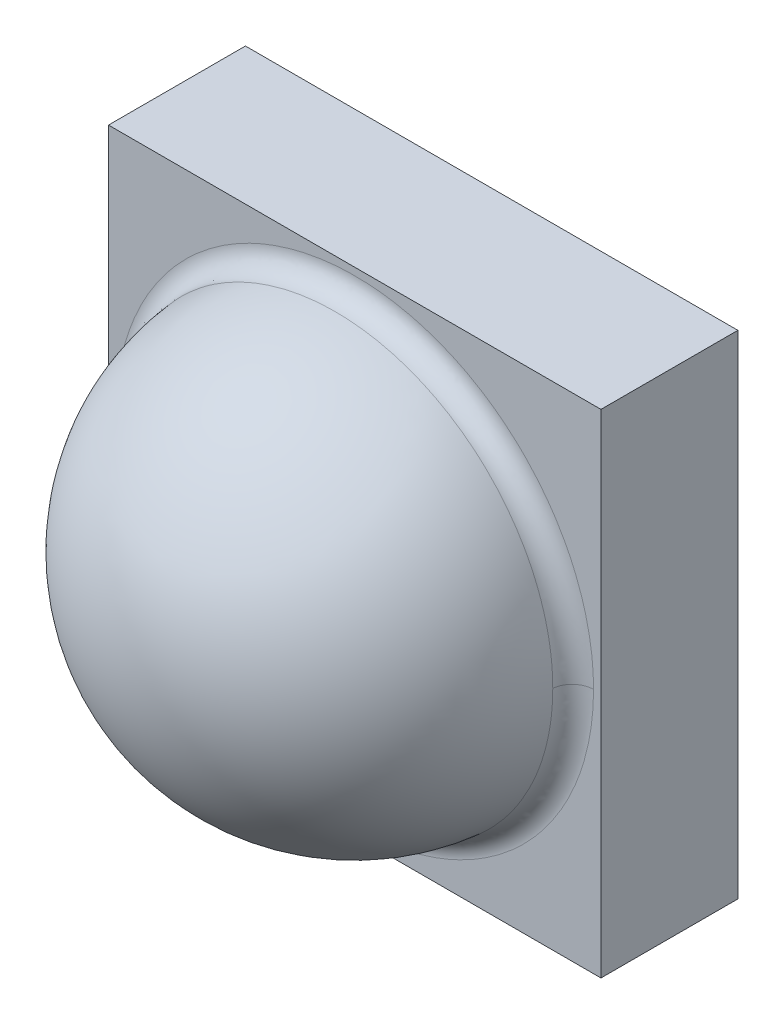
ISO-10303-21;
HEADER;
FILE_DESCRIPTION(('STEP AP214'),'2;1');
FILE_NAME('part.step','',(''),(''),'','','');
FILE_SCHEMA(('AUTOMOTIVE_DESIGN { 1 0 10303 214 1 1 1 1 }'));
ENDSEC;
DATA;
#1=APPLICATION_CONTEXT('core data for automotive mechanical design processes');
#2=APPLICATION_PROTOCOL_DEFINITION('international standard','automotive_design',2000,#1);
#3=PRODUCT_CONTEXT('',#1,'mechanical');
#4=PRODUCT('Part','Part','',(#3));
#5=PRODUCT_RELATED_PRODUCT_CATEGORY('part','',(#4));
#6=PRODUCT_DEFINITION_FORMATION('','',#4);
#7=PRODUCT_DEFINITION_CONTEXT('part definition',#1,'design');
#8=PRODUCT_DEFINITION('design','',#6,#7);
#9=PRODUCT_DEFINITION_SHAPE('','',#8);
#10=(LENGTH_UNIT() NAMED_UNIT(*) SI_UNIT(.MILLI.,.METRE.));
#11=(NAMED_UNIT(*) PLANE_ANGLE_UNIT() SI_UNIT($,.RADIAN.));
#12=(NAMED_UNIT(*) SI_UNIT($,.STERADIAN.) SOLID_ANGLE_UNIT());
#13=UNCERTAINTY_MEASURE_WITH_UNIT(LENGTH_MEASURE(1.E-05),#10,'distance_accuracy_value','');
#14=(GEOMETRIC_REPRESENTATION_CONTEXT(3) GLOBAL_UNCERTAINTY_ASSIGNED_CONTEXT((#13)) GLOBAL_UNIT_ASSIGNED_CONTEXT((#10,
#11,#12)) REPRESENTATION_CONTEXT('',''));
#15=CARTESIAN_POINT('',(0.,0.,0.));
#16=DIRECTION('',(0.,0.,1.));
#17=DIRECTION('',(1.,0.,0.));
#18=AXIS2_PLACEMENT_3D('',#15,#16,#17);
#19=CARTESIAN_POINT('',(0.,0.,-0.68105));
#20=DIRECTION('',(0.,0.,1.));
#21=DIRECTION('',(1.,0.,0.));
#22=AXIS2_PLACEMENT_3D('',#19,#20,#21);
#23=PLANE('',#22);
#24=DIRECTION('',(-1.,0.,0.));
#25=VECTOR('',#24,1.);
#26=CARTESIAN_POINT('',(-1.22475,1.22475,-0.68105));
#27=LINE('',#26,#25);
#28=CARTESIAN_POINT('',(1.22475,1.22475,-0.68105));
#29=VERTEX_POINT('',#28);
#30=CARTESIAN_POINT('',(-1.22475,1.22475,-0.68105));
#31=VERTEX_POINT('',#30);
#32=EDGE_CURVE('E270',#29,#31,#27,.T.);
#33=ORIENTED_EDGE('',*,*,#32,.F.);
#34=DIRECTION('',(0.,1.,0.));
#35=VECTOR('',#34,1.);
#36=CARTESIAN_POINT('',(1.22475,-1.1425,-0.68105));
#37=LINE('',#36,#35);
#38=CARTESIAN_POINT('',(1.22475,-1.22475,-0.68105));
#39=VERTEX_POINT('',#38);
#40=EDGE_CURVE('E306',#39,#29,#37,.T.);
#41=ORIENTED_EDGE('',*,*,#40,.F.);
#42=DIRECTION('',(1.,0.,0.));
#43=VECTOR('',#42,1.);
#44=CARTESIAN_POINT('',(0.,-1.22475,-0.68105));
#45=LINE('',#44,#43);
#46=CARTESIAN_POINT('',(-1.22475,-1.22475,-0.68105));
#47=VERTEX_POINT('',#46);
#48=EDGE_CURVE('E612',#47,#39,#45,.T.);
#49=ORIENTED_EDGE('',*,*,#48,.F.);
#50=DIRECTION('',(0.,-1.,0.));
#51=VECTOR('',#50,1.);
#52=CARTESIAN_POINT('',(-1.22475,-1.22475,-0.68105));
#53=LINE('',#52,#51);
#54=EDGE_CURVE('E308',#31,#47,#53,.T.);
#55=ORIENTED_EDGE('',*,*,#54,.F.);
#56=EDGE_LOOP('',(#33,#41,#49,#55));
#57=FACE_BOUND('',#56,.T.);
#58=DIRECTION('',(1.,0.,0.));
#59=VECTOR('',#58,1.);
#60=CARTESIAN_POINT('',(0.,-1.1425,-0.68105));
#61=LINE('',#60,#59);
#62=CARTESIAN_POINT('',(1.1425,-1.1425,-0.68105));
#63=VERTEX_POINT('',#62);
#64=CARTESIAN_POINT('',(-1.1425,-1.1425,-0.68105));
#65=VERTEX_POINT('',#64);
#66=EDGE_CURVE('E517',#63,#65,#61,.F.);
#67=ORIENTED_EDGE('',*,*,#66,.F.);
#68=DIRECTION('',(0.,-1.,0.));
#69=VECTOR('',#68,1.);
#70=CARTESIAN_POINT('',(1.1425,-1.1425,-0.68105));
#71=LINE('',#70,#69);
#72=CARTESIAN_POINT('',(1.1425,1.1425,-0.68105));
#73=VERTEX_POINT('',#72);
#74=EDGE_CURVE('E206',#73,#63,#71,.T.);
#75=ORIENTED_EDGE('',*,*,#74,.F.);
#76=DIRECTION('',(-1.,0.,0.));
#77=VECTOR('',#76,1.);
#78=CARTESIAN_POINT('',(1.1425,1.1425,-0.68105));
#79=LINE('',#78,#77);
#80=CARTESIAN_POINT('',(0.8165,1.1425,-0.68105));
#81=VERTEX_POINT('',#80);
#82=EDGE_CURVE('E225',#73,#81,#79,.T.);
#83=ORIENTED_EDGE('',*,*,#82,.T.);
#84=DIRECTION('',(0.,-1.,0.));
#85=VECTOR('',#84,1.);
#86=CARTESIAN_POINT('',(0.8165,-1.1425,-0.68105));
#87=LINE('',#86,#85);
#88=CARTESIAN_POINT('',(0.8165,1.1385,-0.68105));
#89=VERTEX_POINT('',#88);
#90=EDGE_CURVE('E229',#81,#89,#87,.T.);
#91=ORIENTED_EDGE('',*,*,#90,.T.);
#92=DIRECTION('',(-1.,0.,0.));
#93=VECTOR('',#92,1.);
#94=CARTESIAN_POINT('',(0.8165,1.1385,-0.68105));
#95=LINE('',#94,#93);
#96=CARTESIAN_POINT('',(0.4615,1.1385,-0.68105));
#97=VERTEX_POINT('',#96);
#98=EDGE_CURVE('E276',#89,#97,#95,.T.);
#99=ORIENTED_EDGE('',*,*,#98,.T.);
#100=DIRECTION('',(0.,1.,0.));
#101=VECTOR('',#100,1.);
#102=CARTESIAN_POINT('',(0.4615,1.1385,-0.68105));
#103=LINE('',#102,#101);
#104=CARTESIAN_POINT('',(0.4615,1.1425,-0.68105));
#105=VERTEX_POINT('',#104);
#106=EDGE_CURVE('E279',#97,#105,#103,.T.);
#107=ORIENTED_EDGE('',*,*,#106,.T.);
#108=DIRECTION('',(-1.,0.,0.));
#109=VECTOR('',#108,1.);
#110=CARTESIAN_POINT('',(0.4615,1.1425,-0.68105));
#111=LINE('',#110,#109);
#112=CARTESIAN_POINT('',(-0.4615,1.1425,-0.68105));
#113=VERTEX_POINT('',#112);
#114=EDGE_CURVE('E282',#105,#113,#111,.T.);
#115=ORIENTED_EDGE('',*,*,#114,.T.);
#116=DIRECTION('',(0.,-1.,0.));
#117=VECTOR('',#116,1.);
#118=CARTESIAN_POINT('',(-0.4615,1.1425,-0.68105));
#119=LINE('',#118,#117);
#120=CARTESIAN_POINT('',(-0.4615,1.1385,-0.68105));
#121=VERTEX_POINT('',#120);
#122=EDGE_CURVE('E285',#113,#121,#119,.T.);
#123=ORIENTED_EDGE('',*,*,#122,.T.);
#124=DIRECTION('',(-1.,0.,0.));
#125=VECTOR('',#124,1.);
#126=CARTESIAN_POINT('',(-0.4615,1.1385,-0.68105));
#127=LINE('',#126,#125);
#128=CARTESIAN_POINT('',(-0.8165,1.1385,-0.68105));
#129=VERTEX_POINT('',#128);
#130=EDGE_CURVE('E288',#121,#129,#127,.T.);
#131=ORIENTED_EDGE('',*,*,#130,.T.);
#132=DIRECTION('',(0.,1.,0.));
#133=VECTOR('',#132,1.);
#134=CARTESIAN_POINT('',(-0.8165,0.,-0.68105));
#135=LINE('',#134,#133);
#136=CARTESIAN_POINT('',(-0.8165,1.1425,-0.68105));
#137=VERTEX_POINT('',#136);
#138=EDGE_CURVE('E401',#129,#137,#135,.T.);
#139=ORIENTED_EDGE('',*,*,#138,.T.);
#140=DIRECTION('',(1.,0.,0.));
#141=VECTOR('',#140,1.);
#142=CARTESIAN_POINT('',(-1.1425,1.1425,-0.68105));
#143=LINE('',#142,#141);
#144=CARTESIAN_POINT('',(-1.1425,1.1425,-0.68105));
#145=VERTEX_POINT('',#144);
#146=EDGE_CURVE('E261',#145,#137,#143,.T.);
#147=ORIENTED_EDGE('',*,*,#146,.F.);
#148=DIRECTION('',(0.,1.,0.));
#149=VECTOR('',#148,1.);
#150=CARTESIAN_POINT('',(-1.1425,1.1425,-0.68105));
#151=LINE('',#150,#149);
#152=EDGE_CURVE('E243',#65,#145,#151,.T.);
#153=ORIENTED_EDGE('',*,*,#152,.F.);
#154=EDGE_LOOP('',(#67,#75,#83,#91,#99,#107,#115,#123,#131,#139,#147,#153));
#155=FACE_BOUND('',#154,.T.);
#156=ADVANCED_FACE('F46',(#57,#155),#23,.F.);
#157=CARTESIAN_POINT('',(1.0863,1.1385,0.));
#158=DIRECTION('',(0.,-1.,0.));
#159=DIRECTION('',(0.,0.,-1.));
#160=AXIS2_PLACEMENT_3D('',#157,#158,#159);
#161=PLANE('',#160);
#162=ORIENTED_EDGE('',*,*,#98,.F.);
#163=DIRECTION('',(0.,0.,1.));
#164=VECTOR('',#163,1.);
#165=CARTESIAN_POINT('',(0.8165,1.1385,-0.69312));
#166=LINE('',#165,#164);
#167=CARTESIAN_POINT('',(0.8165,1.1385,-0.69312));
#168=VERTEX_POINT('',#167);
#169=EDGE_CURVE('E294',#168,#89,#166,.T.);
#170=ORIENTED_EDGE('',*,*,#169,.F.);
#171=DIRECTION('',(-1.,0.,0.));
#172=VECTOR('',#171,1.);
#173=CARTESIAN_POINT('',(1.0863,1.1385,-0.69312));
#174=LINE('',#173,#172);
#175=CARTESIAN_POINT('',(0.4615,1.1385,-0.69312));
#176=VERTEX_POINT('',#175);
#177=EDGE_CURVE('E322',#168,#176,#174,.T.);
#178=ORIENTED_EDGE('',*,*,#177,.T.);
#179=DIRECTION('',(0.,0.,1.));
#180=VECTOR('',#179,1.);
#181=CARTESIAN_POINT('',(0.4615,1.1385,0.));
#182=LINE('',#181,#180);
#183=EDGE_CURVE('E319',#176,#97,#182,.T.);
#184=ORIENTED_EDGE('',*,*,#183,.T.);
#185=EDGE_LOOP('',(#162,#170,#178,#184));
#186=FACE_BOUND('',#185,.T.);
#187=ADVANCED_FACE('F708',(#186),#161,.F.);
#188=CARTESIAN_POINT('',(-1.0863,1.1385,-0.69312));
#189=DIRECTION('',(0.,-1.,0.));
#190=DIRECTION('',(0.,0.,-1.));
#191=AXIS2_PLACEMENT_3D('',#188,#189,#190);
#192=PLANE('',#191);
#193=ORIENTED_EDGE('',*,*,#130,.F.);
#194=DIRECTION('',(0.,0.,-1.));
#195=VECTOR('',#194,1.);
#196=CARTESIAN_POINT('',(-0.4615,1.1385,-0.69312));
#197=LINE('',#196,#195);
#198=CARTESIAN_POINT('',(-0.4615,1.1385,-0.69312));
#199=VERTEX_POINT('',#198);
#200=EDGE_CURVE('E326',#121,#199,#197,.T.);
#201=ORIENTED_EDGE('',*,*,#200,.T.);
#202=DIRECTION('',(1.,0.,0.));
#203=VECTOR('',#202,1.);
#204=CARTESIAN_POINT('',(-1.0863,1.1385,-0.69312));
#205=LINE('',#204,#203);
#206=CARTESIAN_POINT('',(-0.8165,1.1385,-0.69312));
#207=VERTEX_POINT('',#206);
#208=EDGE_CURVE('E333',#207,#199,#205,.T.);
#209=ORIENTED_EDGE('',*,*,#208,.F.);
#210=DIRECTION('',(0.,0.,-1.));
#211=VECTOR('',#210,1.);
#212=CARTESIAN_POINT('',(-0.8165,1.1385,0.));
#213=LINE('',#212,#211);
#214=EDGE_CURVE('E299',#129,#207,#213,.T.);
#215=ORIENTED_EDGE('',*,*,#214,.F.);
#216=EDGE_LOOP('',(#193,#201,#209,#215));
#217=FACE_BOUND('',#216,.T.);
#218=ADVANCED_FACE('F493',(#217),#192,.F.);
#219=CARTESIAN_POINT('',(0.4615,0.,-0.71855));
#220=DIRECTION('',(1.,0.,0.));
#221=DIRECTION('',(0.,0.,-1.));
#222=AXIS2_PLACEMENT_3D('',#219,#220,#221);
#223=PLANE('',#222);
#224=DIRECTION('',(0.,0.,-1.));
#225=VECTOR('',#224,1.);
#226=CARTESIAN_POINT('',(0.4615,1.1425,-0.75605));
#227=LINE('',#226,#225);
#228=CARTESIAN_POINT('',(0.4615,1.1425,-0.75605));
#229=VERTEX_POINT('',#228);
#230=EDGE_CURVE('E339',#105,#229,#227,.T.);
#231=ORIENTED_EDGE('',*,*,#230,.F.);
#232=ORIENTED_EDGE('',*,*,#106,.F.);
#233=ORIENTED_EDGE('',*,*,#183,.F.);
#234=DIRECTION('',(0.,1.,0.));
#235=VECTOR('',#234,1.);
#236=CARTESIAN_POINT('',(0.4615,1.1385,-0.69312));
#237=LINE('',#236,#235);
#238=CARTESIAN_POINT('',(0.4615,-1.1425,-0.69312));
#239=VERTEX_POINT('',#238);
#240=EDGE_CURVE('E316',#239,#176,#237,.T.);
#241=ORIENTED_EDGE('',*,*,#240,.F.);
#242=DIRECTION('',(0.,0.,-1.));
#243=VECTOR('',#242,1.);
#244=CARTESIAN_POINT('',(0.4615,-1.1425,-0.71855));
#245=LINE('',#244,#243);
#246=CARTESIAN_POINT('',(0.4615,-1.1425,-0.75605));
#247=VERTEX_POINT('',#246);
#248=EDGE_CURVE('E512',#239,#247,#245,.T.);
#249=ORIENTED_EDGE('',*,*,#248,.T.);
#250=DIRECTION('',(0.,1.,0.));
#251=VECTOR('',#250,1.);
#252=CARTESIAN_POINT('',(0.4615,0.,-0.75605));
#253=LINE('',#252,#251);
#254=EDGE_CURVE('E508',#247,#229,#253,.T.);
#255=ORIENTED_EDGE('',*,*,#254,.T.);
#256=EDGE_LOOP('',(#231,#232,#233,#241,#249,#255));
#257=FACE_BOUND('',#256,.T.);
#258=ADVANCED_FACE('F505',(#257),#223,.T.);
#259=CARTESIAN_POINT('',(-0.4615,0.,-0.71855));
#260=DIRECTION('',(1.,0.,0.));
#261=DIRECTION('',(0.,0.,-1.));
#262=AXIS2_PLACEMENT_3D('',#259,#260,#261);
#263=PLANE('',#262);
#264=ORIENTED_EDGE('',*,*,#122,.F.);
#265=DIRECTION('',(0.,0.,1.));
#266=VECTOR('',#265,1.);
#267=CARTESIAN_POINT('',(-0.4615,1.1425,0.));
#268=LINE('',#267,#266);
#269=CARTESIAN_POINT('',(-0.4615,1.1425,-0.75605));
#270=VERTEX_POINT('',#269);
#271=EDGE_CURVE('E336',#270,#113,#268,.T.);
#272=ORIENTED_EDGE('',*,*,#271,.F.);
#273=DIRECTION('',(0.,1.,0.));
#274=VECTOR('',#273,1.);
#275=CARTESIAN_POINT('',(-0.4615,0.,-0.75605));
#276=LINE('',#275,#274);
#277=CARTESIAN_POINT('',(-0.4615,-1.1425,-0.75605));
#278=VERTEX_POINT('',#277);
#279=EDGE_CURVE('E520',#278,#270,#276,.T.);
#280=ORIENTED_EDGE('',*,*,#279,.F.);
#281=DIRECTION('',(0.,0.,-1.));
#282=VECTOR('',#281,1.);
#283=CARTESIAN_POINT('',(-0.4615,-1.1425,-0.71855));
#284=LINE('',#283,#282);
#285=CARTESIAN_POINT('',(-0.4615,-1.1425,-0.69312));
#286=VERTEX_POINT('',#285);
#287=EDGE_CURVE('E521',#286,#278,#284,.T.);
#288=ORIENTED_EDGE('',*,*,#287,.F.);
#289=DIRECTION('',(0.,-1.,0.));
#290=VECTOR('',#289,1.);
#291=CARTESIAN_POINT('',(-0.4615,-1.1425,-0.69312));
#292=LINE('',#291,#290);
#293=EDGE_CURVE('E328',#199,#286,#292,.T.);
#294=ORIENTED_EDGE('',*,*,#293,.F.);
#295=ORIENTED_EDGE('',*,*,#200,.F.);
#296=EDGE_LOOP('',(#264,#272,#280,#288,#294,#295));
#297=FACE_BOUND('',#296,.T.);
#298=ADVANCED_FACE('F496',(#297),#263,.F.);
#299=CARTESIAN_POINT('',(0.,1.1425,0.));
#300=DIRECTION('',(0.,-1.,0.));
#301=DIRECTION('',(0.,0.,-1.));
#302=AXIS2_PLACEMENT_3D('',#299,#300,#301);
#303=PLANE('',#302);
#304=ORIENTED_EDGE('',*,*,#114,.F.);
#305=ORIENTED_EDGE('',*,*,#230,.T.);
#306=DIRECTION('',(-1.,0.,0.));
#307=VECTOR('',#306,1.);
#308=CARTESIAN_POINT('',(-0.4615,1.1425,-0.75605));
#309=LINE('',#308,#307);
#310=EDGE_CURVE('E341',#229,#270,#309,.T.);
#311=ORIENTED_EDGE('',*,*,#310,.T.);
#312=ORIENTED_EDGE('',*,*,#271,.T.);
#313=EDGE_LOOP('',(#304,#305,#311,#312));
#314=FACE_BOUND('',#313,.T.);
#315=ADVANCED_FACE('F360',(#314),#303,.F.);
#316=CARTESIAN_POINT('',(-0.9795,-1.1425,-0.71855));
#317=DIRECTION('',(0.,-1.,0.));
#318=DIRECTION('',(0.,0.,-1.));
#319=AXIS2_PLACEMENT_3D('',#316,#317,#318);
#320=PLANE('',#319);
#321=DIRECTION('',(-1.,0.,0.));
#322=VECTOR('',#321,1.);
#323=CARTESIAN_POINT('',(1.0863,-1.1425,-0.69312));
#324=LINE('',#323,#322);
#325=CARTESIAN_POINT('',(0.8165,-1.1425,-0.69312));
#326=VERTEX_POINT('',#325);
#327=EDGE_CURVE('E324',#326,#239,#324,.T.);
#328=ORIENTED_EDGE('',*,*,#327,.F.);
#329=DIRECTION('',(0.,0.,-1.));
#330=VECTOR('',#329,1.);
#331=CARTESIAN_POINT('',(0.8165,-1.1425,-0.75605));
#332=LINE('',#331,#330);
#333=CARTESIAN_POINT('',(0.8165,-1.1425,-0.75605));
#334=VERTEX_POINT('',#333);
#335=EDGE_CURVE('E214',#326,#334,#332,.T.);
#336=ORIENTED_EDGE('',*,*,#335,.T.);
#337=DIRECTION('',(-1.,0.,0.));
#338=VECTOR('',#337,1.);
#339=CARTESIAN_POINT('',(1.1425,-1.1425,-0.75605));
#340=LINE('',#339,#338);
#341=CARTESIAN_POINT('',(1.1425,-1.1425,-0.75605));
#342=VERTEX_POINT('',#341);
#343=EDGE_CURVE('E210',#342,#334,#340,.T.);
#344=ORIENTED_EDGE('',*,*,#343,.F.);
#345=DIRECTION('',(0.,0.,-1.));
#346=VECTOR('',#345,1.);
#347=CARTESIAN_POINT('',(1.1425,-1.1425,-0.75605));
#348=LINE('',#347,#346);
#349=EDGE_CURVE('E199',#63,#342,#348,.T.);
#350=ORIENTED_EDGE('',*,*,#349,.F.);
#351=ORIENTED_EDGE('',*,*,#66,.T.);
#352=DIRECTION('',(0.,0.,1.));
#353=VECTOR('',#352,1.);
#354=CARTESIAN_POINT('',(-1.1425,-1.1425,-0.68105));
#355=LINE('',#354,#353);
#356=CARTESIAN_POINT('',(-1.1425,-1.1425,-0.75605));
#357=VERTEX_POINT('',#356);
#358=EDGE_CURVE('E240',#357,#65,#355,.T.);
#359=ORIENTED_EDGE('',*,*,#358,.F.);
#360=DIRECTION('',(1.,0.,0.));
#361=VECTOR('',#360,1.);
#362=CARTESIAN_POINT('',(-1.1425,-1.1425,-0.75605));
#363=LINE('',#362,#361);
#364=CARTESIAN_POINT('',(-0.8165,-1.1425,-0.75605));
#365=VERTEX_POINT('',#364);
#366=EDGE_CURVE('E250',#357,#365,#363,.T.);
#367=ORIENTED_EDGE('',*,*,#366,.T.);
#368=DIRECTION('',(0.,0.,1.));
#369=VECTOR('',#368,1.);
#370=CARTESIAN_POINT('',(-0.8165,-1.1425,-0.68105));
#371=LINE('',#370,#369);
#372=CARTESIAN_POINT('',(-0.8165,-1.1425,-0.69312));
#373=VERTEX_POINT('',#372);
#374=EDGE_CURVE('E217',#365,#373,#371,.T.);
#375=ORIENTED_EDGE('',*,*,#374,.T.);
#376=DIRECTION('',(1.,0.,0.));
#377=VECTOR('',#376,1.);
#378=CARTESIAN_POINT('',(-1.0863,-1.1425,-0.69312));
#379=LINE('',#378,#377);
#380=EDGE_CURVE('E331',#373,#286,#379,.T.);
#381=ORIENTED_EDGE('',*,*,#380,.T.);
#382=ORIENTED_EDGE('',*,*,#287,.T.);
#383=DIRECTION('',(1.,0.,0.));
#384=VECTOR('',#383,1.);
#385=CARTESIAN_POINT('',(0.,-1.1425,-0.75605));
#386=LINE('',#385,#384);
#387=EDGE_CURVE('E343',#278,#247,#386,.T.);
#388=ORIENTED_EDGE('',*,*,#387,.T.);
#389=ORIENTED_EDGE('',*,*,#248,.F.);
#390=EDGE_LOOP('',(#328,#336,#344,#350,#351,#359,#367,#375,#381,#382,#388,#389));
#391=FACE_BOUND('',#390,.T.);
#392=ADVANCED_FACE('F212',(#391),#320,.T.);
#393=CARTESIAN_POINT('',(1.0863,1.1385,-0.69312));
#394=DIRECTION('',(0.,0.,1.));
#395=DIRECTION('',(1.,0.,0.));
#396=AXIS2_PLACEMENT_3D('',#393,#394,#395);
#397=PLANE('',#396);
#398=DIRECTION('',(0.,1.,0.));
#399=VECTOR('',#398,1.);
#400=CARTESIAN_POINT('',(0.8165,-1.1425,-0.69312));
#401=LINE('',#400,#399);
#402=EDGE_CURVE('E291',#326,#168,#401,.T.);
#403=ORIENTED_EDGE('',*,*,#402,.F.);
#404=ORIENTED_EDGE('',*,*,#327,.T.);
#405=ORIENTED_EDGE('',*,*,#240,.T.);
#406=ORIENTED_EDGE('',*,*,#177,.F.);
#407=EDGE_LOOP('',(#403,#404,#405,#406));
#408=FACE_BOUND('',#407,.T.);
#409=ADVANCED_FACE('F710',(#408),#397,.F.);
#410=CARTESIAN_POINT('',(-1.0863,-1.1425,-0.69312));
#411=DIRECTION('',(0.,0.,1.));
#412=DIRECTION('',(1.,0.,0.));
#413=AXIS2_PLACEMENT_3D('',#410,#411,#412);
#414=PLANE('',#413);
#415=DIRECTION('',(0.,-1.,0.));
#416=VECTOR('',#415,1.);
#417=CARTESIAN_POINT('',(-0.8165,1.1385,-0.69312));
#418=LINE('',#417,#416);
#419=EDGE_CURVE('E297',#207,#373,#418,.T.);
#420=ORIENTED_EDGE('',*,*,#419,.F.);
#421=ORIENTED_EDGE('',*,*,#208,.T.);
#422=ORIENTED_EDGE('',*,*,#293,.T.);
#423=ORIENTED_EDGE('',*,*,#380,.F.);
#424=EDGE_LOOP('',(#420,#421,#422,#423));
#425=FACE_BOUND('',#424,.T.);
#426=ADVANCED_FACE('F490',(#425),#414,.F.);
#427=CARTESIAN_POINT('',(0.,0.,0.));
#428=DIRECTION('',(0.,0.,1.));
#429=DIRECTION('',(1.,0.,0.));
#430=AXIS2_PLACEMENT_3D('',#427,#428,#429);
#431=PLANE('',#430);
#432=CARTESIAN_POINT('',(1.03777116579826,0.578325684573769,0.));
#433=CARTESIAN_POINT('',(0.952707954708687,0.530921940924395,0.));
#434=CARTESIAN_POINT('',(0.945113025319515,0.526689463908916,0.0969910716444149));
#435=CARTESIAN_POINT('',(1.07038677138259,0.519890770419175,0.));
#436=CARTESIAN_POINT('',(0.982650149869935,0.477276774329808,0.));
#437=CARTESIAN_POINT('',(0.974816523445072,0.473471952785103,0.0969910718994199));
#438=CARTESIAN_POINT('',(1.09796197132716,0.458702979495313,0.));
#439=CARTESIAN_POINT('',(1.00796508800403,0.421104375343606,0.));
#440=CARTESIAN_POINT('',(0.999929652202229,0.417747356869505,0.0969910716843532));
#441=CARTESIAN_POINT('',(1.14242507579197,0.332741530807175,0.));
#442=CARTESIAN_POINT('',(1.04878367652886,0.305467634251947,0.));
#443=CARTESIAN_POINT('',(1.04042283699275,0.303032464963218,0.0969910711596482));
#444=CARTESIAN_POINT('',(1.15934115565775,0.267977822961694,0.));
#445=CARTESIAN_POINT('',(1.06431319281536,0.246012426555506,0.));
#446=CARTESIAN_POINT('',(1.05582855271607,0.2440512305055,0.0969910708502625));
#447=CARTESIAN_POINT('',(1.18223222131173,0.135449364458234,0.));
#448=CARTESIAN_POINT('',(1.08532794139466,0.124346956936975,0.));
#449=CARTESIAN_POINT('',(1.07667577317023,0.123355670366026,0.0969910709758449));
#450=CARTESIAN_POINT('',(1.1880358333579,0.0676538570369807,0.));
#451=CARTESIAN_POINT('',(1.09065584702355,0.0621084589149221,0.));
#452=CARTESIAN_POINT('',(1.08196120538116,0.0616133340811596,0.0969910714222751));
#453=CARTESIAN_POINT('',(1.1880360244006,-0.000795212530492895,0.));
#454=CARTESIAN_POINT('',(1.09065602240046,-0.000730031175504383,0.));
#455=CARTESIAN_POINT('',(1.08196137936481,-0.000724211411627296,0.0969910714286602));
#456=CARTESIAN_POINT('',(1.18803522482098,-0.00159040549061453,0.));
#457=CARTESIAN_POINT('',(1.09065528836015,-0.00146004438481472,0.));
#458=CARTESIAN_POINT('',(1.08196065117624,-0.00144840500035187,0.0969910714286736));
#459=CARTESIAN_POINT('',(1.18802723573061,-0.00556640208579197,0.));
#460=CARTESIAN_POINT('',(1.09064795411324,-0.00511013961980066,0.));
#461=CARTESIAN_POINT('',(1.08195337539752,-0.00506940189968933,0.0969910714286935));
#462=CARTESIAN_POINT('',(1.18800807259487,-0.00874722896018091,0.));
#463=CARTESIAN_POINT('',(1.09063036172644,-0.00803024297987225,0.));
#464=CARTESIAN_POINT('',(1.08193592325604,-0.0079662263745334,0.0969910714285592));
#465=CARTESIAN_POINT('',(1.18784840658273,-0.0246521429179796,0.));
#466=CARTESIAN_POINT('',(1.09048378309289,-0.0226314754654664,0.));
#467=CARTESIAN_POINT('',(1.08179051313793,-0.0224510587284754,0.0969910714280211));
#468=CARTESIAN_POINT('',(1.18751634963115,-0.0373739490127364,0.));
#469=CARTESIAN_POINT('',(1.09017894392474,-0.0343105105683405,0.));
#470=CARTESIAN_POINT('',(1.08148810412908,-0.0340369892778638,0.0969910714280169));
#471=CARTESIAN_POINT('',(1.18482855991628,-0.101050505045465,0.));
#472=CARTESIAN_POINT('',(1.0877114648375,-0.0927676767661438,0.));
#473=CARTESIAN_POINT('',(1.07904029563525,-0.0920281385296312,0.0969910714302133));
#474=CARTESIAN_POINT('',(1.17939008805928,-0.151909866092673,0.));
#475=CARTESIAN_POINT('',(1.08271876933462,-0.139458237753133,0.));
#476=CARTESIAN_POINT('',(1.07408740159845,-0.138346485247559,0.096991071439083));
#477=CARTESIAN_POINT('',(1.15933972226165,-0.267978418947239,0.));
#478=CARTESIAN_POINT('',(1.06431187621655,-0.246012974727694,0.));
#479=CARTESIAN_POINT('',(1.05582724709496,-0.244051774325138,0.0969910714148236));
#480=CARTESIAN_POINT('',(1.14242292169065,-0.33279598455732,0.));
#481=CARTESIAN_POINT('',(1.04878169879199,-0.305517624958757,0.));
#482=CARTESIAN_POINT('',(1.04042087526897,-0.303082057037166,0.0969910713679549));
#483=CARTESIAN_POINT('',(1.09792020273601,-0.458772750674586,0.));
#484=CARTESIAN_POINT('',(1.00792674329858,-0.421168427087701,0.));
#485=CARTESIAN_POINT('',(0.99989161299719,-0.417810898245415,0.0969910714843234));
#486=CARTESIAN_POINT('',(1.07031643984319,-0.519925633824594,0.));
#487=CARTESIAN_POINT('',(0.982585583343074,-0.477308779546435,0.));
#488=CARTESIAN_POINT('',(0.974752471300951,-0.473503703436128,0.096991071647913));
#489=CARTESIAN_POINT('',(1.00525398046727,-0.636675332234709,0.));
#490=CARTESIAN_POINT('',(0.922856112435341,-0.584488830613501,0.));
#491=CARTESIAN_POINT('',(0.915499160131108,-0.579829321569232,0.0969910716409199));
#492=CARTESIAN_POINT('',(0.967803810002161,-0.692276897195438,0.));
#493=CARTESIAN_POINT('',(0.888475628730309,-0.635532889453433,0.));
#494=CARTESIAN_POINT('',(0.881392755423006,-0.630466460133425,0.0969910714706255));
#495=CARTESIAN_POINT('',(0.884098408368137,-0.796405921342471,0.));
#496=CARTESIAN_POINT('',(0.811631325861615,-0.731126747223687,0.));
#497=CARTESIAN_POINT('',(0.805161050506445,-0.725298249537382,0.0969910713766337));
#498=CARTESIAN_POINT('',(0.837842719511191,-0.844933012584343,0.));
#499=CARTESIAN_POINT('',(0.769167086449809,-0.775676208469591,0.));
#500=CARTESIAN_POINT('',(0.763035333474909,-0.76949256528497,0.0969910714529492));
#501=CARTESIAN_POINT('',(0.737843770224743,-0.933529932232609,0.));
#502=CARTESIAN_POINT('',(0.677364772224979,-0.857011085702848,0.));
#503=CARTESIAN_POINT('',(0.67196486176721,-0.850179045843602,0.0969910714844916));
#504=CARTESIAN_POINT('',(0.684100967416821,-0.973600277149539,0.));
#505=CARTESIAN_POINT('',(0.628027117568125,-0.893796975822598,0.));
#506=CARTESIAN_POINT('',(0.623020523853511,-0.886671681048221,0.0969910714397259));
#507=CARTESIAN_POINT('',(0.570647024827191,-1.04415239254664,0.));
#508=CARTESIAN_POINT('',(0.523872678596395,-0.958566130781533,0.));
#509=CARTESIAN_POINT('',(0.519696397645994,-0.950924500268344,0.0969910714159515));
#510=CARTESIAN_POINT('',(0.510935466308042,-1.07463348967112,0.));
#511=CARTESIAN_POINT('',(0.469055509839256,-0.986548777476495,0.));
#512=CARTESIAN_POINT('',(0.465316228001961,-0.978684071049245,0.0969910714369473));
#513=CARTESIAN_POINT('',(0.387286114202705,-1.12512021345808,0.));
#514=CARTESIAN_POINT('',(0.355541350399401,-1.0328972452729,0.));
#515=CARTESIAN_POINT('',(0.352706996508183,-1.02466305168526,0.0969910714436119));
#516=CARTESIAN_POINT('',(0.323351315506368,-1.14513317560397,0.));
#517=CARTESIAN_POINT('',(0.296847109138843,-1.05126980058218,0.));
#518=CARTESIAN_POINT('',(0.294480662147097,-1.04288914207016,0.0969910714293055));
#519=CARTESIAN_POINT('',(0.192942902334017,-1.17416815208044,0.));
#520=CARTESIAN_POINT('',(0.1771279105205,-1.0779248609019,0.));
#521=CARTESIAN_POINT('',(0.175715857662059,-1.06933170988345,0.096991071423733));
#522=CARTESIAN_POINT('',(0.126466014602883,-1.18317546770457,0.));
#523=CARTESIAN_POINT('',(0.116099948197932,-1.08619387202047,0.));
#524=CARTESIAN_POINT('',(0.115174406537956,-1.07753480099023,0.0969910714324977));
#525=CARTESIAN_POINT('',(-0.00700988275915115,-1.18989187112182,0.));
#526=CARTESIAN_POINT('',(-0.00643530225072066,-1.09235975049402,0.));
#527=CARTESIAN_POINT('',(-0.00638400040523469,-1.0836515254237,0.0969910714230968));
#528=CARTESIAN_POINT('',(-0.0740085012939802,-1.18760873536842,0.));
#529=CARTESIAN_POINT('',(-0.067942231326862,-1.09026375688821,0.));
#530=CARTESIAN_POINT('',(-0.0674006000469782,-1.08157224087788,0.0969910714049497));
#531=CARTESIAN_POINT('',(-0.206674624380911,-1.17182665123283,0.));
#532=CARTESIAN_POINT('',(-0.189734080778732,-1.07577528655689,0.));
#533=CARTESIAN_POINT('',(-0.18822153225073,-1.06719927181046,0.0969910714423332));
#534=CARTESIAN_POINT('',(-0.272342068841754,-1.15832719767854,0.));
#535=CARTESIAN_POINT('',(-0.250018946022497,-1.06338234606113,0.));
#536=CARTESIAN_POINT('',(-0.248025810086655,-1.05490512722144,0.096991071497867));
#537=CARTESIAN_POINT('',(-0.400475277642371,-1.12049600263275,0.));
#538=CARTESIAN_POINT('',(-0.367649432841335,-1.02865206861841,0.));
#539=CARTESIAN_POINT('',(-0.364718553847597,-1.02045171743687,0.0969910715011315));
#540=CARTESIAN_POINT('',(-0.462941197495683,-1.09616478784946,0.));
#541=CARTESIAN_POINT('',(-0.42499519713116,-1.0063152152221,0.));
#542=CARTESIAN_POINT('',(-0.421607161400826,-0.998292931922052,0.0969910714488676));
#543=CARTESIAN_POINT('',(-0.582904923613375,-1.03735911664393,0.));
#544=CARTESIAN_POINT('',(-0.535125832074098,-0.952329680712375,0.));
#545=CARTESIAN_POINT('',(-0.530859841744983,-0.944737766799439,0.096991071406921));
#546=CARTESIAN_POINT('',(-0.64040247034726,-1.00288413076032,0.));
#547=CARTESIAN_POINT('',(-0.58791046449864,-0.92068051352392,0.));
#548=CARTESIAN_POINT('',(-0.583223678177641,-0.913340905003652,0.0969910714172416));
#549=CARTESIAN_POINT('',(-0.748755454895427,-0.924798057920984,0.));
#550=CARTESIAN_POINT('',(-0.687382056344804,-0.848994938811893,0.));
#551=CARTESIAN_POINT('',(-0.681902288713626,-0.842226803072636,0.0969910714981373));
#552=CARTESIAN_POINT('',(-0.799615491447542,-0.881193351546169,0.));
#553=CARTESIAN_POINT('',(-0.734073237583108,-0.808964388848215,0.));
#554=CARTESIAN_POINT('',(-0.728221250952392,-0.802515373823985,0.0969910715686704));
#555=CARTESIAN_POINT('',(-0.893362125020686,-0.786003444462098,0.));
#556=CARTESIAN_POINT('',(-0.820135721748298,-0.721576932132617,0.));
#557=CARTESIAN_POINT('',(-0.813597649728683,-0.715824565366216,0.0969910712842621));
#558=CARTESIAN_POINT('',(-0.936237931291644,-0.734407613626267,0.));
#559=CARTESIAN_POINT('',(-0.859497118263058,-0.67421026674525,0.));
#560=CARTESIAN_POINT('',(-0.852645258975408,-0.668835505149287,0.0969910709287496));
#561=CARTESIAN_POINT('',(-1.01266160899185,-0.624823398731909,0.));
#562=CARTESIAN_POINT('',(-0.92965655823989,-0.573608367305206,0.));
#563=CARTESIAN_POINT('',(-0.922245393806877,-0.569035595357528,0.0969910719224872));
#564=CARTESIAN_POINT('',(-1.0462216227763,-0.566843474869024,0.));
#565=CARTESIAN_POINT('',(-0.960465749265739,-0.520380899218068,0.));
#566=CARTESIAN_POINT('',(-0.952808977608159,-0.51623245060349,0.0969910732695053));
#567=CARTESIAN_POINT('',(-1.10317574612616,-0.445978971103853,0.));
#568=CARTESIAN_POINT('',(-1.01275150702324,-0.409423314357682,0.));
#569=CARTESIAN_POINT('',(-1.00467791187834,-0.406159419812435,0.0969910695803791));
#570=CARTESIAN_POINT('',(-1.12655677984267,-0.383088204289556,0.));
#571=CARTESIAN_POINT('',(-1.0342160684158,-0.351687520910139,0.));
#572=CARTESIAN_POINT('',(-1.02597135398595,-0.348883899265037,0.0969910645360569));
#573=CARTESIAN_POINT('',(-1.15892786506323,-0.266868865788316,0.));
#574=CARTESIAN_POINT('',(-1.06393377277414,-0.244994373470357,0.));
#575=CARTESIAN_POINT('',(-1.0554521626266,-0.243041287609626,0.096991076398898));
#576=CARTESIAN_POINT('',(-1.16983309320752,-0.21406142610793,0.));
#577=CARTESIAN_POINT('',(-1.0739451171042,-0.196515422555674,0.));
#578=CARTESIAN_POINT('',(-1.06538370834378,-0.194948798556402,0.0969910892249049));
#579=CARTESIAN_POINT('',(-1.18438248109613,-0.107477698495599,0.));
#580=CARTESIAN_POINT('',(-1.0873019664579,-0.0986680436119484,0.));
#581=CARTESIAN_POINT('',(-1.07863404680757,-0.0978814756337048,0.0969910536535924));
#582=CARTESIAN_POINT('',(-1.18803590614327,-0.0537027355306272,0.));
#583=CARTESIAN_POINT('',(-1.09065597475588,-0.049300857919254,0.));
#584=CARTESIAN_POINT('',(-1.08196127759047,-0.0489078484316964,0.0969910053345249));
#585=CARTESIAN_POINT('',(-1.18803602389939,0.000795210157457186,0.));
#586=CARTESIAN_POINT('',(-1.09065602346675,0.000730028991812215,0.));
#587=CARTESIAN_POINT('',(-1.08196137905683,0.00072420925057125,0.0969910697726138));
#588=CARTESIAN_POINT('',(-1.18803522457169,0.00159040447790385,0.));
#589=CARTESIAN_POINT('',(-1.09065528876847,0.0014600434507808,0.));
#590=CARTESIAN_POINT('',(-1.08196065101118,0.00144840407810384,0.0969910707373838));
#591=CARTESIAN_POINT('',(-1.18802723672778,0.00556640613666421,0.));
#592=CARTESIAN_POINT('',(-1.09064795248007,0.00511014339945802,0.));
#593=CARTESIAN_POINT('',(-1.08195337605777,0.0050694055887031,0.0969910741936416));
#594=CARTESIAN_POINT('',(-1.18800807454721,0.0087472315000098,0.));
#595=CARTESIAN_POINT('',(-1.09063036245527,0.00803024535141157,0.));
#596=CARTESIAN_POINT('',(-1.08193592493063,0.00796622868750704,0.0969910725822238));
#597=CARTESIAN_POINT('',(-1.18784839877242,0.0246521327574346,0.));
#598=CARTESIAN_POINT('',(-1.09048378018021,0.0226314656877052,0.));
#599=CARTESIAN_POINT('',(-1.08179050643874,0.0224510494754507,0.096991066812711));
#600=CARTESIAN_POINT('',(-1.18751628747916,0.0373739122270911,0.));
#601=CARTESIAN_POINT('',(-1.09017888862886,0.0343104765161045,0.));
#602=CARTESIAN_POINT('',(-1.08148804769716,0.0340369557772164,0.0969910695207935));
#603=CARTESIAN_POINT('',(-1.18482880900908,0.101050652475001,0.));
#604=CARTESIAN_POINT('',(-1.08771168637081,0.0927678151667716,0.));
#605=CARTESIAN_POINT('',(-1.07904052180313,0.0920282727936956,0.0969910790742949));
#606=CARTESIAN_POINT('',(-1.17939245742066,0.151911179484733,0.));
#607=CARTESIAN_POINT('',(-1.08272094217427,0.13945944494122,0.));
#608=CARTESIAN_POINT('',(-1.07408955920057,0.13834768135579,0.0969910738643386));
#609=CARTESIAN_POINT('',(-1.15935024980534,0.267897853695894,0.));
#610=CARTESIAN_POINT('',(-1.06432154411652,0.24593900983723,0.));
#611=CARTESIAN_POINT('',(-1.0558368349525,0.24397840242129,0.096991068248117));
#612=CARTESIAN_POINT('',(-1.14244964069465,0.332632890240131,0.));
#613=CARTESIAN_POINT('',(-1.04880622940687,0.30536789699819,0.));
#614=CARTESIAN_POINT('',(-1.04044520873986,0.302933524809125,0.0969910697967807));
#615=CARTESIAN_POINT('',(-1.09800055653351,0.458632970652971,0.));
#616=CARTESIAN_POINT('',(-1.00800050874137,0.421040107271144,0.));
#617=CARTESIAN_POINT('',(-0.999964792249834,0.417683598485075,0.0969910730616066));
#618=CARTESIAN_POINT('',(-1.0704089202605,0.519882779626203,0.));
#619=CARTESIAN_POINT('',(-0.982670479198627,0.477269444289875,0.));
#620=CARTESIAN_POINT('',(-0.974836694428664,0.473464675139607,0.0969910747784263));
#621=CARTESIAN_POINT('',(-1.03777116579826,0.578325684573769,0.));
#622=CARTESIAN_POINT('',(-0.952707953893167,0.530921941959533,0.));
#623=CARTESIAN_POINT('',(-0.945113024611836,0.526689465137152,0.0969910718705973));
#624=(BOUNDED_SURFACE() B_SPLINE_SURFACE(3,2,((#432,#433,#434),(#435,#436,#437),(#438,#439,
#440),(#441,#442,#443),(#444,#445,#446),(#447,#448,#449),(#450,#451,#452),(#453,#454,#455),
(#456,#457,#458),(#459,#460,#461),(#462,#463,#464),(#465,#466,#467),(#468,#469,#470),(#471,#472,
#473),(#474,#475,#476),(#477,#478,#479),(#480,#481,#482),(#483,#484,#485),(#486,#487,#488),
(#489,#490,#491),(#492,#493,#494),(#495,#496,#497),(#498,#499,#500),(#501,#502,#503),(#504,#505,
#506),(#507,#508,#509),(#510,#511,#512),(#513,#514,#515),(#516,#517,#518),(#519,#520,#521),
(#522,#523,#524),(#525,#526,#527),(#528,#529,#530),(#531,#532,#533),(#534,#535,#536),(#537,#538,
#539),(#540,#541,#542),(#543,#544,#545),(#546,#547,#548),(#549,#550,#551),(#552,#553,#554),
(#555,#556,#557),(#558,#559,#560),(#561,#562,#563),(#564,#565,#566),(#567,#568,#569),(#570,#571,
#572),(#573,#574,#575),(#576,#577,#578),(#579,#580,#581),(#582,#583,#584),(#585,#586,#587),
(#588,#589,#590),(#591,#592,#593),(#594,#595,#596),(#597,#598,#599),(#600,#601,#602),(#603,#604,
#605),(#606,#607,#608),(#609,#610,#611),(#612,#613,#614),(#615,#616,#617),(#618,#619,#620),
(#621,#622,#623)),.UNSPECIFIED.,.F.,.F.,.F.) B_SPLINE_SURFACE_WITH_KNOTS((4,2,2,2,2,2,2,2,2,2,2,
2,2,2,2,2,2,2,2,2,2,2,2,2,2,2,2,2,2,2,2,4),(3,3),(0.,0.200431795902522,0.400331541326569,
0.603290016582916,0.605675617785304,0.615218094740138,0.653392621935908,0.806388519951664,
1.00638659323,1.20672006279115,1.40688063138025,1.60705160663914,1.8072103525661,
2.00738315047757,2.2074154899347,2.40771469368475,2.60787595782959,2.80804623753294,
3.0082067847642,3.20837778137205,3.40840934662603,3.60870932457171,3.80874698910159,
4.00904086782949,4.17035333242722,4.33145956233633,4.33384516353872,4.34338764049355,
4.38156216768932,4.53455806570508,4.73431633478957,4.9348896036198),(0.,1.),
.UNSPECIFIED.) GEOMETRIC_REPRESENTATION_ITEM() RATIONAL_B_SPLINE_SURFACE(((1.,0.737999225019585,
1.),(1.,0.737999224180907,1.),(1.,0.737999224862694,1.),(1.,0.737999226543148,1.),(1.,
0.73799922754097,1.),(1.,0.737999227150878,1.),(1.,0.737999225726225,1.),(1.,0.737999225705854,
1.),(1.,0.737999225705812,1.),(1.,0.737999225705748,1.),(1.,0.737999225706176,1.),(1.,
0.737999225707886,1.),(1.,0.737999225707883,1.),(1.,0.737999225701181,1.),(1.,0.737999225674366,
1.),(1.,0.73799922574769,1.),(1.,0.737999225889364,1.),(1.,0.737999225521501,1.),(1.,
0.737999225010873,1.),(1.,0.73799922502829,1.),(1.,0.73799922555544,1.),(1.,0.737999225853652,
1.),(1.,0.737999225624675,1.),(1.,0.737999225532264,1.),(1.,0.737999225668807,1.),(1.,
0.737999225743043,1.),(1.,0.737999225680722,1.),(1.,0.737999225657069,1.),(1.,0.737999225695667,
1.),(1.,0.737999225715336,1.),(1.,0.737999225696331,1.),(1.,0.737999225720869,1.),(1.,
0.737999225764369,1.),(1.,0.737999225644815,1.),(1.,0.737999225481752,1.),(1.,0.737999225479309,
1.),(1.,0.737999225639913,1.),(1.,0.737999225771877,1.),(1.,0.737999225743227,1.),(1.,
0.737999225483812,1.),(1.,0.737999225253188,1.),(1.,0.737999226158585,1.),(1.,0.73799922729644,
1.),(1.,0.737999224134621,1.),(1.,0.737999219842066,1.),(1.,0.737999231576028,1.),(1.,
0.737999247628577,1.),(1.,0.737999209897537,1.),(1.,0.737999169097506,1.),(1.,0.737999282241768,
1.),(1.,0.737999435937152,1.),(1.,0.737999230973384,1.),(1.,0.737999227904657,1.),(1.,
0.737999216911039,1.),(1.,0.737999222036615,1.),(1.,0.737999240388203,1.),(1.,0.737999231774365,
1.),(1.,0.737999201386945,1.),(1.,0.737999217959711,1.),(1.,0.737999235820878,1.),(1.,
0.737999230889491,1.),(1.,0.737999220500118,1.),(1.,0.737999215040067,1.),(1.,0.737999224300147,1.))) REPRESENTATION_ITEM('') SURFACE());
#625=CARTESIAN_POINT('',(1.03777116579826,0.578325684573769,0.));
#626=CARTESIAN_POINT('',(1.07038677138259,0.519890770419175,0.));
#627=CARTESIAN_POINT('',(1.09796197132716,0.458702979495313,0.));
#628=CARTESIAN_POINT('',(1.14242507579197,0.332741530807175,0.));
#629=CARTESIAN_POINT('',(1.15934115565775,0.267977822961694,0.));
#630=CARTESIAN_POINT('',(1.18223222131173,0.135449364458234,0.));
#631=CARTESIAN_POINT('',(1.18803583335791,0.0676538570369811,0.));
#632=CARTESIAN_POINT('',(1.1880360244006,-0.000795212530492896,0.));
#633=CARTESIAN_POINT('',(1.18803522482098,-0.00159040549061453,0.));
#634=CARTESIAN_POINT('',(1.18802723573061,-0.00556640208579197,0.));
#635=CARTESIAN_POINT('',(1.18800807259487,-0.00874722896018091,0.));
#636=CARTESIAN_POINT('',(1.18784840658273,-0.0246521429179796,0.));
#637=CARTESIAN_POINT('',(1.18751634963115,-0.0373739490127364,0.));
#638=CARTESIAN_POINT('',(1.18482855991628,-0.101050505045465,0.));
#639=CARTESIAN_POINT('',(1.17939008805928,-0.151909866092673,0.));
#640=CARTESIAN_POINT('',(1.15933972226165,-0.267978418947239,0.));
#641=CARTESIAN_POINT('',(1.14242292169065,-0.33279598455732,0.));
#642=CARTESIAN_POINT('',(1.09792020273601,-0.458772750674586,0.));
#643=CARTESIAN_POINT('',(1.07031643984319,-0.519925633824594,0.));
#644=CARTESIAN_POINT('',(1.00525398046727,-0.636675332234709,0.));
#645=CARTESIAN_POINT('',(0.967803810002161,-0.692276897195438,0.));
#646=CARTESIAN_POINT('',(0.884098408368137,-0.796405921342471,0.));
#647=CARTESIAN_POINT('',(0.837842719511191,-0.844933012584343,0.));
#648=CARTESIAN_POINT('',(0.737843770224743,-0.933529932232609,0.));
#649=CARTESIAN_POINT('',(0.684100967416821,-0.973600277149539,0.));
#650=CARTESIAN_POINT('',(0.570647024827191,-1.04415239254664,0.));
#651=CARTESIAN_POINT('',(0.510935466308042,-1.07463348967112,0.));
#652=CARTESIAN_POINT('',(0.387286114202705,-1.12512021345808,0.));
#653=CARTESIAN_POINT('',(0.323351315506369,-1.14513317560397,0.));
#654=CARTESIAN_POINT('',(0.192942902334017,-1.17416815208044,0.));
#655=CARTESIAN_POINT('',(0.126466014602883,-1.18317546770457,0.));
#656=CARTESIAN_POINT('',(-0.0070098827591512,-1.18989187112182,0.));
#657=CARTESIAN_POINT('',(-0.0740085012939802,-1.18760873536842,0.));
#658=CARTESIAN_POINT('',(-0.206674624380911,-1.17182665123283,0.));
#659=CARTESIAN_POINT('',(-0.272342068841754,-1.15832719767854,0.));
#660=CARTESIAN_POINT('',(-0.400475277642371,-1.12049600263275,0.));
#661=CARTESIAN_POINT('',(-0.462941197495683,-1.09616478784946,0.));
#662=CARTESIAN_POINT('',(-0.582904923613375,-1.03735911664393,0.));
#663=CARTESIAN_POINT('',(-0.64040247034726,-1.00288413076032,0.));
#664=CARTESIAN_POINT('',(-0.748755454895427,-0.924798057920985,0.));
#665=CARTESIAN_POINT('',(-0.799615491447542,-0.881193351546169,0.));
#666=CARTESIAN_POINT('',(-0.893362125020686,-0.786003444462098,0.));
#667=CARTESIAN_POINT('',(-0.936237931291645,-0.734407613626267,0.));
#668=CARTESIAN_POINT('',(-1.01266160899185,-0.624823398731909,0.));
#669=CARTESIAN_POINT('',(-1.0462216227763,-0.566843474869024,0.));
#670=CARTESIAN_POINT('',(-1.10317574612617,-0.445978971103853,0.));
#671=CARTESIAN_POINT('',(-1.12655677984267,-0.383088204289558,0.));
#672=CARTESIAN_POINT('',(-1.15892786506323,-0.266868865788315,0.));
#673=CARTESIAN_POINT('',(-1.16983309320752,-0.214061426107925,0.));
#674=CARTESIAN_POINT('',(-1.18438248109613,-0.107477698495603,0.));
#675=CARTESIAN_POINT('',(-1.18803590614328,-0.0537027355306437,0.));
#676=CARTESIAN_POINT('',(-1.18803602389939,0.000795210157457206,0.));
#677=CARTESIAN_POINT('',(-1.18803522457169,0.00159040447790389,0.));
#678=CARTESIAN_POINT('',(-1.18802723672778,0.00556640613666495,0.));
#679=CARTESIAN_POINT('',(-1.18800807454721,0.00874723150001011,0.));
#680=CARTESIAN_POINT('',(-1.18784839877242,0.0246521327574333,0.));
#681=CARTESIAN_POINT('',(-1.18751628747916,0.0373739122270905,0.));
#682=CARTESIAN_POINT('',(-1.18482880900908,0.101050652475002,0.));
#683=CARTESIAN_POINT('',(-1.17939245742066,0.151911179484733,0.));
#684=CARTESIAN_POINT('',(-1.15935024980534,0.267897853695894,0.));
#685=CARTESIAN_POINT('',(-1.14244964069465,0.332632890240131,0.));
#686=CARTESIAN_POINT('',(-1.09800055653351,0.458632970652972,0.));
#687=CARTESIAN_POINT('',(-1.0704089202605,0.519882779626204,0.));
#688=CARTESIAN_POINT('',(-1.03777116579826,0.578325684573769,0.));
#689=B_SPLINE_CURVE_WITH_KNOTS('',3,(#625,#626,#627,#628,#629,#630,#631,#632,#633,#634,#635,
#636,#637,#638,#639,#640,#641,#642,#643,#644,#645,#646,#647,#648,#649,#650,#651,#652,#653,#654,
#655,#656,#657,#658,#659,#660,#661,#662,#663,#664,#665,#666,#667,#668,#669,#670,#671,#672,#673,
#674,#675,#676,#677,#678,#679,#680,#681,#682,#683,#684,#685,#686,#687,#688),.UNSPECIFIED.,.F.,
.F.,(4,2,2,2,2,2,2,2,2,2,2,2,2,2,2,2,2,2,2,2,2,2,2,2,2,2,2,2,2,2,2,4),(0.,0.200431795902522,
0.400331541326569,0.603290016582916,0.605675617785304,0.615218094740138,0.653392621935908,
0.806388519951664,1.00638659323,1.20672006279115,1.40688063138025,1.60705160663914,
1.8072103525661,2.00738315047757,2.2074154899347,2.40771469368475,2.60787595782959,
2.80804623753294,3.0082067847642,3.20837778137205,3.40840934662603,3.60870932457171,
3.80874698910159,4.00904086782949,4.17035333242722,4.33145956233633,4.33384516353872,
4.34338764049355,4.38156216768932,4.53455806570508,4.73431633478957,4.9348896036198),.UNSPECIFIED.);
#690=CARTESIAN_POINT('',(1.18803602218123,0.,0.));
#691=VERTEX_POINT('',#690);
#692=CARTESIAN_POINT('',(-1.18803602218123,0.,0.));
#693=VERTEX_POINT('',#692);
#694=EDGE_CURVE('E58',#691,#693,#689,.T.);
#695=ORIENTED_EDGE('',*,*,#694,.T.);
#696=CARTESIAN_POINT('',(-1.03777116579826,-0.578325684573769,0.));
#697=CARTESIAN_POINT('',(-0.95270795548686,-0.530921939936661,0.));
#698=CARTESIAN_POINT('',(-0.945113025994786,-0.526689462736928,0.0969910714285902));
#699=CARTESIAN_POINT('',(-1.07038677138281,-0.519890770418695,0.));
#700=CARTESIAN_POINT('',(-0.982650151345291,-0.477276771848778,0.));
#701=CARTESIAN_POINT('',(-0.97481652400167,-0.47347195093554,0.096991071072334));
#702=CARTESIAN_POINT('',(-1.09796197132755,-0.458702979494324,0.));
#703=CARTESIAN_POINT('',(-1.00796508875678,-0.421104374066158,0.));
#704=CARTESIAN_POINT('',(-0.999929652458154,-0.417747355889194,0.0969910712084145));
#705=CARTESIAN_POINT('',(-1.14242507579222,-0.332741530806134,0.));
#706=CARTESIAN_POINT('',(-1.0487836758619,-0.305467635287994,0.));
#707=CARTESIAN_POINT('',(-1.04042283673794,-0.303032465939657,0.0969910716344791));
#708=CARTESIAN_POINT('',(-1.15934115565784,-0.267977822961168,0.));
#709=CARTESIAN_POINT('',(-1.06431319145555,-0.246012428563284,0.));
#710=CARTESIAN_POINT('',(-1.05582855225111,-0.244051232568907,0.0969910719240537));
#711=CARTESIAN_POINT('',(-1.18223222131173,-0.135449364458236,0.));
#712=CARTESIAN_POINT('',(-1.08532794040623,-0.124346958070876,0.));
#713=CARTESIAN_POINT('',(-1.07667577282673,-0.123355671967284,0.0969910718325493));
#714=CARTESIAN_POINT('',(-1.1880358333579,-0.0676538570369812,0.));
#715=CARTESIAN_POINT('',(-1.09065584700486,-0.0621084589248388,0.));
#716=CARTESIAN_POINT('',(-1.08196120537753,-0.0616133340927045,0.0969910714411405));
#717=CARTESIAN_POINT('',(-1.1880360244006,0.000795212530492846,0.));
#718=CARTESIAN_POINT('',(-1.09065602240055,0.000730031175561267,0.));
#719=CARTESIAN_POINT('',(-1.08196137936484,0.000724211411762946,0.0969910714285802));
#720=CARTESIAN_POINT('',(-1.18803522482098,0.00159040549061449,0.));
#721=CARTESIAN_POINT('',(-1.09065528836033,0.00146004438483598,0.));
#722=CARTESIAN_POINT('',(-1.08196065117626,0.00144840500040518,0.0969910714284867));
#723=CARTESIAN_POINT('',(-1.18802723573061,0.00556640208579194,0.));
#724=CARTESIAN_POINT('',(-1.09064795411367,0.00511013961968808,0.));
#725=CARTESIAN_POINT('',(-1.08195337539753,0.00506940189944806,0.096991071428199));
#726=CARTESIAN_POINT('',(-1.18800807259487,0.00874722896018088,0.));
#727=CARTESIAN_POINT('',(-1.09063036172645,0.00803024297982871,0.));
#728=CARTESIAN_POINT('',(-1.08193592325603,0.00796622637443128,0.0969910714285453));
#729=CARTESIAN_POINT('',(-1.18784840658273,0.0246521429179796,0.));
#730=CARTESIAN_POINT('',(-1.09048378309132,0.0226314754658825,0.));
#731=CARTESIAN_POINT('',(-1.08179051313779,0.0224510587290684,0.0969910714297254));
#732=CARTESIAN_POINT('',(-1.18751634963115,0.0373739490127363,0.));
#733=CARTESIAN_POINT('',(-1.09017894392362,0.0343105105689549,0.));
#734=CARTESIAN_POINT('',(-1.08148810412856,0.0340369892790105,0.0969910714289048));
#735=CARTESIAN_POINT('',(-1.18482855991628,0.101050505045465,0.));
#736=CARTESIAN_POINT('',(-1.08771146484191,0.0927676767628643,0.));
#737=CARTESIAN_POINT('',(-1.07904029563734,0.0920281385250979,0.0969910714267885));
#738=CARTESIAN_POINT('',(-1.17939008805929,0.151909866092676,0.));
#739=CARTESIAN_POINT('',(-1.08271876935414,0.139458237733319,0.));
#740=CARTESIAN_POINT('',(-1.07408740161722,0.138346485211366,0.0969910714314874));
#741=CARTESIAN_POINT('',(-1.15933972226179,0.267978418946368,0.));
#742=CARTESIAN_POINT('',(-1.06431187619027,0.246012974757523,0.));
#743=CARTESIAN_POINT('',(-1.05582724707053,0.244051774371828,0.0969910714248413));
#744=CARTESIAN_POINT('',(-1.14242292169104,0.332795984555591,0.));
#745=CARTESIAN_POINT('',(-1.04878169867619,0.305517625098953,0.));
#746=CARTESIAN_POINT('',(-1.04042087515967,0.303082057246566,0.0969910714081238));
#747=CARTESIAN_POINT('',(-1.09792020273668,0.458772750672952,0.));
#748=CARTESIAN_POINT('',(-1.00792674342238,0.421168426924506,0.));
#749=CARTESIAN_POINT('',(-0.99989161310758,0.417810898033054,0.0969910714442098));
#750=CARTESIAN_POINT('',(-1.0703164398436,0.519925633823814,0.));
#751=CARTESIAN_POINT('',(-0.982585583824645,0.477308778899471,0.));
#752=CARTESIAN_POINT('',(-0.974752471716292,0.473503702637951,0.09699107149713));
#753=CARTESIAN_POINT('',(-1.00525398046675,0.636675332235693,0.));
#754=CARTESIAN_POINT('',(-0.92285611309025,0.584488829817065,0.));
#755=CARTESIAN_POINT('',(-0.915499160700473,0.579829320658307,0.0969910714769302));
#756=CARTESIAN_POINT('',(-0.967803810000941,0.692276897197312,0.));
#757=CARTESIAN_POINT('',(-0.888475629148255,0.635532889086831,0.));
#758=CARTESIAN_POINT('',(-0.881392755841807,0.630466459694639,0.0969910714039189));
#759=CARTESIAN_POINT('',(-0.884098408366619,0.796405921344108,0.));
#760=CARTESIAN_POINT('',(-0.811631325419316,0.731126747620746,0.));
#761=CARTESIAN_POINT('',(-0.805161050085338,0.72529824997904,0.0969910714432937));
#762=CARTESIAN_POINT('',(-0.837842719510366,0.844933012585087,0.));
#763=CARTESIAN_POINT('',(-0.769167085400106,0.77567620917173,0.));
#764=CARTESIAN_POINT('',(-0.763035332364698,0.769492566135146,0.0969910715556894));
#765=CARTESIAN_POINT('',(-0.737843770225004,0.933529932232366,0.));
#766=CARTESIAN_POINT('',(-0.677364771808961,0.857011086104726,0.));
#767=CARTESIAN_POINT('',(-0.671964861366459,0.850179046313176,0.0969910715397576));
#768=CARTESIAN_POINT('',(-0.684100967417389,0.973600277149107,0.));
#769=CARTESIAN_POINT('',(-0.628027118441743,0.893796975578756,0.));
#770=CARTESIAN_POINT('',(-0.62302052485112,0.886671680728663,0.0969910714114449));
#771=CARTESIAN_POINT('',(-0.570647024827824,1.04415239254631,0.));
#772=CARTESIAN_POINT('',(-0.523872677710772,0.958566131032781,0.));
#773=CARTESIAN_POINT('',(-0.519696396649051,0.950924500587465,0.096991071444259));
#774=CARTESIAN_POINT('',(-0.51093546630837,1.07463348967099,0.));
#775=CARTESIAN_POINT('',(-0.469055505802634,0.986548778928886,0.));
#776=CARTESIAN_POINT('',(-0.465316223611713,0.978684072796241,0.0969910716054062));
#777=CARTESIAN_POINT('',(-0.387286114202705,1.12512021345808,0.));
#778=CARTESIAN_POINT('',(-0.355541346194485,1.03289724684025,0.));
#779=CARTESIAN_POINT('',(-0.352706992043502,1.02466305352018,0.0969910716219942));
#780=CARTESIAN_POINT('',(-0.323351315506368,1.14513317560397,0.));
#781=CARTESIAN_POINT('',(-0.296847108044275,1.05126980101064,0.));
#782=CARTESIAN_POINT('',(-0.294480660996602,1.04288914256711,0.0969910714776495));
#783=CARTESIAN_POINT('',(-0.192942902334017,1.17416815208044,0.));
#784=CARTESIAN_POINT('',(-0.177127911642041,1.07792486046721,0.));
#785=CARTESIAN_POINT('',(-0.175715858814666,1.06933170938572,0.0969910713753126));
#786=CARTESIAN_POINT('',(-0.126466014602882,1.18317546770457,0.));
#787=CARTESIAN_POINT('',(-0.116099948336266,1.08619387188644,0.));
#788=CARTESIAN_POINT('',(-0.115174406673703,1.07753480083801,0.0969910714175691));
#789=CARTESIAN_POINT('',(0.00700988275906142,1.18989187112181,0.));
#790=CARTESIAN_POINT('',(0.00643530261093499,1.09235975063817,0.));
#791=CARTESIAN_POINT('',(0.0063840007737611,1.08365152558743,0.0969910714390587));
#792=CARTESIAN_POINT('',(0.0740085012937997,1.18760873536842,0.));
#793=CARTESIAN_POINT('',(0.0679422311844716,1.09026375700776,0.));
#794=CARTESIAN_POINT('',(0.0674005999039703,1.0815722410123,0.0969910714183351));
#795=CARTESIAN_POINT('',(0.206674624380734,1.17182665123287,0.));
#796=CARTESIAN_POINT('',(0.189734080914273,1.07577528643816,0.));
#797=CARTESIAN_POINT('',(0.188221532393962,1.06719927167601,0.0969910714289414));
#798=CARTESIAN_POINT('',(0.272342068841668,1.15832719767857,0.));
#799=CARTESIAN_POINT('',(0.250018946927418,1.06338234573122,0.));
#800=CARTESIAN_POINT('',(0.248025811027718,1.05490512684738,0.0969910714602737));
#801=CARTESIAN_POINT('',(0.40047527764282,1.12049600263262,0.));
#802=CARTESIAN_POINT('',(0.367649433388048,1.02865206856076,0.));
#803=CARTESIAN_POINT('',(0.364718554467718,1.02045171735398,0.0969910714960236));
#804=CARTESIAN_POINT('',(0.462941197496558,1.09616478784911,0.));
#805=CARTESIAN_POINT('',(0.424995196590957,1.00631521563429,0.));
#806=CARTESIAN_POINT('',(0.421607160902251,0.998292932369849,0.0969910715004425));
#807=CARTESIAN_POINT('',(0.582904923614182,1.03735911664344,0.));
#808=CARTESIAN_POINT('',(0.535125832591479,0.952329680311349,0.));
#809=CARTESIAN_POINT('',(0.530859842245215,0.94473776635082,0.0969910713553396));
#810=CARTESIAN_POINT('',(0.640402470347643,1.00288413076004,0.));
#811=CARTESIAN_POINT('',(0.58791046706,0.920680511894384,0.));
#812=CARTESIAN_POINT('',(0.583223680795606,0.913340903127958,0.0969910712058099));
#813=CARTESIAN_POINT('',(0.748755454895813,0.924798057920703,0.));
#814=CARTESIAN_POINT('',(0.687382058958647,0.848994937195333,0.));
#815=CARTESIAN_POINT('',(0.681902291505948,0.842226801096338,0.0969910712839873));
#816=CARTESIAN_POINT('',(0.799615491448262,0.881193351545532,0.));
#817=CARTESIAN_POINT('',(0.734073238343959,0.808964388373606,0.));
#818=CARTESIAN_POINT('',(0.728221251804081,0.802515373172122,0.0969910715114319));
#819=CARTESIAN_POINT('',(0.893362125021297,0.78600344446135,0.));
#820=CARTESIAN_POINT('',(0.820135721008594,0.721576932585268,0.));
#821=CARTESIAN_POINT('',(0.813597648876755,0.715824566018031,0.0969910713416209));
#822=CARTESIAN_POINT('',(0.936237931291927,0.734407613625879,0.));
#823=CARTESIAN_POINT('',(0.859497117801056,0.67421026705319,0.));
#824=CARTESIAN_POINT('',(0.852645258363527,0.668835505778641,0.0969910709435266));
#825=CARTESIAN_POINT('',(1.01266160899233,0.624823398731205,0.));
#826=CARTESIAN_POINT('',(0.929656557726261,0.573608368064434,0.));
#827=CARTESIAN_POINT('',(0.922245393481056,0.569035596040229,0.0969910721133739));
#828=CARTESIAN_POINT('',(1.04622162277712,0.566843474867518,0.));
#829=CARTESIAN_POINT('',(0.960465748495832,0.520380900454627,0.));
#830=CARTESIAN_POINT('',(0.952808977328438,0.516232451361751,0.0969910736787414));
#831=CARTESIAN_POINT('',(1.10317574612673,0.445978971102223,0.));
#832=CARTESIAN_POINT('',(1.01275150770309,0.409423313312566,0.));
#833=CARTESIAN_POINT('',(1.00467791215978,0.406159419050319,0.0969910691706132));
#834=CARTESIAN_POINT('',(1.12655677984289,0.383088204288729,0.));
#835=CARTESIAN_POINT('',(1.03421607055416,0.351687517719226,0.));
#836=CARTESIAN_POINT('',(1.02597135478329,0.348883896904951,0.0969910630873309));
#837=CARTESIAN_POINT('',(1.15892786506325,0.266868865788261,0.));
#838=CARTESIAN_POINT('',(1.06393377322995,0.2449943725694,0.));
#839=CARTESIAN_POINT('',(1.05545216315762,0.243041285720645,0.0969910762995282));
#840=CARTESIAN_POINT('',(1.16983309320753,0.214061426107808,0.));
#841=CARTESIAN_POINT('',(1.07394511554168,0.196515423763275,0.));
#842=CARTESIAN_POINT('',(1.06538370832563,0.194948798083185,0.0969910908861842));
#843=CARTESIAN_POINT('',(1.18438248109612,0.107477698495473,0.));
#844=CARTESIAN_POINT('',(1.08730196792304,0.0986680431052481,0.));
#845=CARTESIAN_POINT('',(1.07863404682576,0.0978814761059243,0.0969910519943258));
#846=CARTESIAN_POINT('',(1.18803590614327,0.0537027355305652,0.));
#847=CARTESIAN_POINT('',(1.0906559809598,0.0493008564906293,0.));
#848=CARTESIAN_POINT('',(1.08196127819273,0.0489078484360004,0.0969909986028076));
#849=CARTESIAN_POINT('',(1.18803602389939,-0.000795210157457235,0.));
#850=CARTESIAN_POINT('',(1.09065602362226,-0.000730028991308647,0.));
#851=CARTESIAN_POINT('',(1.08196137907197,-0.000724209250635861,0.0969910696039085));
#852=CARTESIAN_POINT('',(1.18803522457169,-0.00159040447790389,0.));
#853=CARTESIAN_POINT('',(1.09065528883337,-0.00146004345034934,0.));
#854=CARTESIAN_POINT('',(1.0819606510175,-0.00144840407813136,0.0969910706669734));
#855=CARTESIAN_POINT('',(1.18802723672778,-0.00556640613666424,0.));
#856=CARTESIAN_POINT('',(1.09064795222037,-0.00511014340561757,0.));
#857=CARTESIAN_POINT('',(1.08195337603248,-0.00506940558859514,0.0969910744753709));
#858=CARTESIAN_POINT('',(1.18800807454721,-0.00874723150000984,0.));
#859=CARTESIAN_POINT('',(1.0906303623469,-0.00803024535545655,0.));
#860=CARTESIAN_POINT('',(1.08193592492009,-0.00796622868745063,0.0969910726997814));
#861=CARTESIAN_POINT('',(1.18784839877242,-0.0246521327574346,0.));
#862=CARTESIAN_POINT('',(1.09048378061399,-0.022631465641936,0.));
#863=CARTESIAN_POINT('',(1.08179050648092,-0.022451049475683,0.0969910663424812));
#864=CARTESIAN_POINT('',(1.18751628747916,-0.0373739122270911,0.));
#865=CARTESIAN_POINT('',(1.09017888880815,-0.0343104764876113,0.));
#866=CARTESIAN_POINT('',(1.08148804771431,-0.0340369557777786,0.0969910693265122));
#867=CARTESIAN_POINT('',(1.18482880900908,-0.101050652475,0.));
#868=CARTESIAN_POINT('',(1.0877116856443,-0.0927678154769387,0.));
#869=CARTESIAN_POINT('',(1.07904052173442,-0.0920282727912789,0.0969910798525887));
#870=CARTESIAN_POINT('',(1.17939245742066,-0.151911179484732,0.));
#871=CARTESIAN_POINT('',(1.08272094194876,-0.139459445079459,0.));
#872=CARTESIAN_POINT('',(1.07408955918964,-0.138347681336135,0.0969910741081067));
#873=CARTESIAN_POINT('',(1.15935024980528,-0.267897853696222,0.));
#874=CARTESIAN_POINT('',(1.06432154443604,-0.245939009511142,0.));
#875=CARTESIAN_POINT('',(1.05583683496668,-0.243978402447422,0.0969910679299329));
#876=CARTESIAN_POINT('',(1.1424496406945,-0.332632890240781,0.));
#877=CARTESIAN_POINT('',(1.04880622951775,-0.305367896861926,0.));
#878=CARTESIAN_POINT('',(1.04044520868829,-0.302933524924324,0.0969910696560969));
#879=CARTESIAN_POINT('',(1.09800055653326,-0.458632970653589,0.));
#880=CARTESIAN_POINT('',(1.00800050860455,-0.421040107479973,0.));
#881=CARTESIAN_POINT('',(0.999964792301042,-0.417683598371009,0.0969910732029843));
#882=CARTESIAN_POINT('',(1.07040892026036,-0.519882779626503,0.));
#883=CARTESIAN_POINT('',(0.982670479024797,-0.477269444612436,0.));
#884=CARTESIAN_POINT('',(0.974836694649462,-0.473464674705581,0.0969910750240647));
#885=CARTESIAN_POINT('',(1.03777116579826,-0.578325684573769,0.));
#886=CARTESIAN_POINT('',(0.952707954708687,-0.530921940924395,0.));
#887=CARTESIAN_POINT('',(0.945113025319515,-0.526689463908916,0.0969910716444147));
#888=(BOUNDED_SURFACE() B_SPLINE_SURFACE(3,2,((#696,#697,#698),(#699,#700,#701),(#702,#703,
#704),(#705,#706,#707),(#708,#709,#710),(#711,#712,#713),(#714,#715,#716),(#717,#718,#719),
(#720,#721,#722),(#723,#724,#725),(#726,#727,#728),(#729,#730,#731),(#732,#733,#734),(#735,#736,
#737),(#738,#739,#740),(#741,#742,#743),(#744,#745,#746),(#747,#748,#749),(#750,#751,#752),
(#753,#754,#755),(#756,#757,#758),(#759,#760,#761),(#762,#763,#764),(#765,#766,#767),(#768,#769,
#770),(#771,#772,#773),(#774,#775,#776),(#777,#778,#779),(#780,#781,#782),(#783,#784,#785),
(#786,#787,#788),(#789,#790,#791),(#792,#793,#794),(#795,#796,#797),(#798,#799,#800),(#801,#802,
#803),(#804,#805,#806),(#807,#808,#809),(#810,#811,#812),(#813,#814,#815),(#816,#817,#818),
(#819,#820,#821),(#822,#823,#824),(#825,#826,#827),(#828,#829,#830),(#831,#832,#833),(#834,#835,
#836),(#837,#838,#839),(#840,#841,#842),(#843,#844,#845),(#846,#847,#848),(#849,#850,#851),
(#852,#853,#854),(#855,#856,#857),(#858,#859,#860),(#861,#862,#863),(#864,#865,#866),(#867,#868,
#869),(#870,#871,#872),(#873,#874,#875),(#876,#877,#878),(#879,#880,#881),(#882,#883,#884),
(#885,#886,#887)),.UNSPECIFIED.,.F.,.F.,.F.) B_SPLINE_SURFACE_WITH_KNOTS((4,2,2,2,2,2,2,2,2,2,2,
2,2,2,2,2,2,2,2,2,2,2,2,2,2,2,2,2,2,2,2,4),(3,3),(0.,0.200431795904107,0.400331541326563,
0.60329001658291,0.605675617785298,0.615218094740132,0.653392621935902,0.806388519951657,
1.00638659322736,1.20672006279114,1.40688063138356,1.60705160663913,1.80721035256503,
2.00738315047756,2.20741548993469,2.40771469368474,2.60787595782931,2.80804623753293,
3.00820678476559,3.20837778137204,3.40840934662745,3.60870932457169,3.80874698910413,
4.00904086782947,4.17035333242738,4.33145956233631,4.33384516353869,4.34338764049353,
4.3815621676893,4.53455806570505,4.73431633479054,4.93488960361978),(0.,1.),
.UNSPECIFIED.) GEOMETRIC_REPRESENTATION_ITEM() RATIONAL_B_SPLINE_SURFACE(((1.,0.737999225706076,
1.),(1.,0.737999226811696,1.),(1.,0.737999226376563,1.),(1.,0.737999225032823,1.),(1.,
0.737999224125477,1.),(1.,0.737999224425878,1.),(1.,0.737999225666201,1.),(1.,0.737999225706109,
1.),(1.,0.737999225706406,1.),(1.,0.737999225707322,1.),(1.,0.737999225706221,1.),(1.,
0.737999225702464,1.),(1.,0.737999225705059,1.),(1.,0.737999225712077,1.),(1.,0.737999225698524,
1.),(1.,0.737999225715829,1.),(1.,0.737999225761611,1.),(1.,0.737999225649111,1.),(1.,
0.737999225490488,1.),(1.,0.737999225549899,1.),(1.,0.737999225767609,1.),(1.,0.737999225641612,
1.),(1.,0.737999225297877,1.),(1.,0.737999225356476,1.),(1.,0.737999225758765,1.),(1.,
0.737999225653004,1.),(1.,0.737999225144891,1.),(1.,0.737999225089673,1.),(1.,0.737999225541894,
1.),(1.,0.737999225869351,1.),(1.,0.737999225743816,1.),(1.,0.737999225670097,1.),(1.,
0.737999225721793,1.),(1.,0.737999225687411,1.),(1.,0.737999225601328,1.),(1.,0.737999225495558,
1.),(1.,0.737999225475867,1.),(1.,0.737999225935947,1.),(1.,0.737999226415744,1.),(1.,
0.737999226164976,1.),(1.,0.737999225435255,1.),(1.,0.737999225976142,1.),(1.,0.737999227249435,
1.),(1.,0.737999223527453,1.),(1.,0.737999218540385,1.),(1.,0.737999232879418,1.),(1.,
0.737999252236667,1.),(1.,0.737999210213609,1.),(1.,0.737999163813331,1.),(1.,0.737999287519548,
1.),(1.,0.73799945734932,1.),(1.,0.73799923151,1.),(1.,0.737999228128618,1.),(1.,
0.737999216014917,1.),(1.,0.737999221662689,1.),(1.,0.737999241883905,1.),(1.,0.737999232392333,
1.),(1.,0.737999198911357,1.),(1.,0.737999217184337,1.),(1.,0.737999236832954,1.),(1.,
0.737999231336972,1.),(1.,0.737999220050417,1.),(1.,0.737999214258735,1.),(1.,0.737999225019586,1.))) REPRESENTATION_ITEM('') SURFACE());
#889=CARTESIAN_POINT('',(-1.03777116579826,-0.578325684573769,0.));
#890=CARTESIAN_POINT('',(-1.07038677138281,-0.519890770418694,0.));
#891=CARTESIAN_POINT('',(-1.09796197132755,-0.458702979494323,0.));
#892=CARTESIAN_POINT('',(-1.14242507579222,-0.332741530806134,0.));
#893=CARTESIAN_POINT('',(-1.15934115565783,-0.267977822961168,0.));
#894=CARTESIAN_POINT('',(-1.18223222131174,-0.135449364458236,0.));
#895=CARTESIAN_POINT('',(-1.18803583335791,-0.0676538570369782,0.));
#896=CARTESIAN_POINT('',(-1.1880360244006,0.000795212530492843,0.));
#897=CARTESIAN_POINT('',(-1.18803522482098,0.00159040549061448,0.));
#898=CARTESIAN_POINT('',(-1.18802723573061,0.00556640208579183,0.));
#899=CARTESIAN_POINT('',(-1.18800807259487,0.00874722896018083,0.));
#900=CARTESIAN_POINT('',(-1.18784840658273,0.0246521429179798,0.));
#901=CARTESIAN_POINT('',(-1.18751634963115,0.0373739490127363,0.));
#902=CARTESIAN_POINT('',(-1.18482855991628,0.101050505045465,0.));
#903=CARTESIAN_POINT('',(-1.17939008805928,0.151909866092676,0.));
#904=CARTESIAN_POINT('',(-1.15933972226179,0.267978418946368,0.));
#905=CARTESIAN_POINT('',(-1.14242292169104,0.332795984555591,0.));
#906=CARTESIAN_POINT('',(-1.09792020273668,0.458772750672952,0.));
#907=CARTESIAN_POINT('',(-1.0703164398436,0.519925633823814,0.));
#908=CARTESIAN_POINT('',(-1.00525398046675,0.636675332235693,0.));
#909=CARTESIAN_POINT('',(-0.967803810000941,0.692276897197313,0.));
#910=CARTESIAN_POINT('',(-0.884098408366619,0.796405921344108,0.));
#911=CARTESIAN_POINT('',(-0.837842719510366,0.844933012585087,0.));
#912=CARTESIAN_POINT('',(-0.737843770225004,0.933529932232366,0.));
#913=CARTESIAN_POINT('',(-0.684100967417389,0.973600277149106,0.));
#914=CARTESIAN_POINT('',(-0.570647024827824,1.04415239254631,0.));
#915=CARTESIAN_POINT('',(-0.51093546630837,1.07463348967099,0.));
#916=CARTESIAN_POINT('',(-0.387286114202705,1.12512021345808,0.));
#917=CARTESIAN_POINT('',(-0.323351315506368,1.14513317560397,0.));
#918=CARTESIAN_POINT('',(-0.192942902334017,1.17416815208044,0.));
#919=CARTESIAN_POINT('',(-0.126466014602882,1.18317546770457,0.));
#920=CARTESIAN_POINT('',(0.00700988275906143,1.18989187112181,0.));
#921=CARTESIAN_POINT('',(0.0740085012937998,1.18760873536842,0.));
#922=CARTESIAN_POINT('',(0.206674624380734,1.17182665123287,0.));
#923=CARTESIAN_POINT('',(0.272342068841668,1.15832719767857,0.));
#924=CARTESIAN_POINT('',(0.400475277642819,1.12049600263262,0.));
#925=CARTESIAN_POINT('',(0.462941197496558,1.09616478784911,0.));
#926=CARTESIAN_POINT('',(0.582904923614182,1.03735911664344,0.));
#927=CARTESIAN_POINT('',(0.640402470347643,1.00288413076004,0.));
#928=CARTESIAN_POINT('',(0.748755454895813,0.924798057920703,0.));
#929=CARTESIAN_POINT('',(0.799615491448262,0.881193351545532,0.));
#930=CARTESIAN_POINT('',(0.893362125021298,0.786003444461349,0.));
#931=CARTESIAN_POINT('',(0.936237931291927,0.734407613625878,0.));
#932=CARTESIAN_POINT('',(1.01266160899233,0.624823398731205,0.));
#933=CARTESIAN_POINT('',(1.04622162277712,0.566843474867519,0.));
#934=CARTESIAN_POINT('',(1.10317574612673,0.445978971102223,0.));
#935=CARTESIAN_POINT('',(1.12655677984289,0.383088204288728,0.));
#936=CARTESIAN_POINT('',(1.15892786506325,0.266868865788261,0.));
#937=CARTESIAN_POINT('',(1.16983309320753,0.21406142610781,0.));
#938=CARTESIAN_POINT('',(1.18438248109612,0.107477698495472,0.));
#939=CARTESIAN_POINT('',(1.18803590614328,0.0537027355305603,0.));
#940=CARTESIAN_POINT('',(1.18803602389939,-0.000795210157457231,0.));
#941=CARTESIAN_POINT('',(1.18803522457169,-0.00159040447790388,0.));
#942=CARTESIAN_POINT('',(1.18802723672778,-0.00556640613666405,0.));
#943=CARTESIAN_POINT('',(1.18800807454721,-0.00874723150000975,0.));
#944=CARTESIAN_POINT('',(1.18784839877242,-0.0246521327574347,0.));
#945=CARTESIAN_POINT('',(1.18751628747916,-0.0373739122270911,0.));
#946=CARTESIAN_POINT('',(1.18482880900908,-0.101050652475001,0.));
#947=CARTESIAN_POINT('',(1.17939245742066,-0.151911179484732,0.));
#948=CARTESIAN_POINT('',(1.15935024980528,-0.267897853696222,0.));
#949=CARTESIAN_POINT('',(1.1424496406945,-0.332632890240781,0.));
#950=CARTESIAN_POINT('',(1.09800055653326,-0.458632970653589,0.));
#951=CARTESIAN_POINT('',(1.07040892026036,-0.519882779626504,0.));
#952=CARTESIAN_POINT('',(1.03777116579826,-0.578325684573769,0.));
#953=B_SPLINE_CURVE_WITH_KNOTS('',3,(#889,#890,#891,#892,#893,#894,#895,#896,#897,#898,#899,
#900,#901,#902,#903,#904,#905,#906,#907,#908,#909,#910,#911,#912,#913,#914,#915,#916,#917,#918,
#919,#920,#921,#922,#923,#924,#925,#926,#927,#928,#929,#930,#931,#932,#933,#934,#935,#936,#937,
#938,#939,#940,#941,#942,#943,#944,#945,#946,#947,#948,#949,#950,#951,#952),.UNSPECIFIED.,.F.,
.F.,(4,2,2,2,2,2,2,2,2,2,2,2,2,2,2,2,2,2,2,2,2,2,2,2,2,2,2,2,2,2,2,4),(0.,0.200431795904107,
0.400331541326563,0.60329001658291,0.605675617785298,0.615218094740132,0.653392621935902,
0.806388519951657,1.00638659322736,1.20672006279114,1.40688063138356,1.60705160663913,
1.80721035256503,2.00738315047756,2.20741548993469,2.40771469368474,2.60787595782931,
2.80804623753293,3.00820678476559,3.20837778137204,3.40840934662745,3.60870932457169,
3.80874698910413,4.00904086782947,4.17035333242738,4.33145956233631,4.33384516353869,
4.34338764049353,4.3815621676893,4.53455806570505,4.73431633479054,4.93488960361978),.UNSPECIFIED.);
#954=EDGE_CURVE('E13',#693,#691,#953,.T.);
#955=ORIENTED_EDGE('',*,*,#954,.T.);
#956=EDGE_LOOP('',(#695,#955));
#957=FACE_BOUND('',#956,.T.);
#958=DIRECTION('',(1.,0.,0.));
#959=VECTOR('',#958,1.);
#960=CARTESIAN_POINT('',(1.22475,1.22475,0.));
#961=LINE('',#960,#959);
#962=CARTESIAN_POINT('',(-1.22475,1.22475,0.));
#963=VERTEX_POINT('',#962);
#964=CARTESIAN_POINT('',(1.22475,1.22475,0.));
#965=VERTEX_POINT('',#964);
#966=EDGE_CURVE('E264',#963,#965,#961,.T.);
#967=ORIENTED_EDGE('',*,*,#966,.F.);
#968=DIRECTION('',(0.,1.,0.));
#969=VECTOR('',#968,1.);
#970=CARTESIAN_POINT('',(-1.22475,1.1385,0.));
#971=LINE('',#970,#969);
#972=CARTESIAN_POINT('',(-1.22475,-1.22475,0.));
#973=VERTEX_POINT('',#972);
#974=EDGE_CURVE('E314',#973,#963,#971,.T.);
#975=ORIENTED_EDGE('',*,*,#974,.F.);
#976=DIRECTION('',(1.,0.,0.));
#977=VECTOR('',#976,1.);
#978=CARTESIAN_POINT('',(0.,-1.22475,0.));
#979=LINE('',#978,#977);
#980=CARTESIAN_POINT('',(1.22475,-1.22475,0.));
#981=VERTEX_POINT('',#980);
#982=EDGE_CURVE('E346',#973,#981,#979,.T.);
#983=ORIENTED_EDGE('',*,*,#982,.T.);
#984=DIRECTION('',(0.,-1.,0.));
#985=VECTOR('',#984,1.);
#986=CARTESIAN_POINT('',(1.22475,-1.22475,0.));
#987=LINE('',#986,#985);
#988=EDGE_CURVE('E301',#965,#981,#987,.T.);
#989=ORIENTED_EDGE('',*,*,#988,.F.);
#990=EDGE_LOOP('',(#967,#975,#983,#989));
#991=FACE_BOUND('',#990,.T.);
#992=ADVANCED_FACE('F362',(#957,#991),#431,.T.);
#993=CARTESIAN_POINT('',(0.,-1.22475,-0.43105));
#994=DIRECTION('',(0.,-1.,0.));
#995=DIRECTION('',(0.,0.,-1.));
#996=AXIS2_PLACEMENT_3D('',#993,#994,#995);
#997=PLANE('',#996);
#998=ORIENTED_EDGE('',*,*,#982,.F.);
#999=DIRECTION('',(0.,0.,1.));
#1000=VECTOR('',#999,1.);
#1001=CARTESIAN_POINT('',(-1.22475,-1.22475,0.));
#1002=LINE('',#1001,#1000);
#1003=EDGE_CURVE('E311',#47,#973,#1002,.T.);
#1004=ORIENTED_EDGE('',*,*,#1003,.F.);
#1005=ORIENTED_EDGE('',*,*,#48,.T.);
#1006=DIRECTION('',(0.,0.,-1.));
#1007=VECTOR('',#1006,1.);
#1008=CARTESIAN_POINT('',(1.22475,-1.22475,-0.68105));
#1009=LINE('',#1008,#1007);
#1010=EDGE_CURVE('E303',#981,#39,#1009,.T.);
#1011=ORIENTED_EDGE('',*,*,#1010,.F.);
#1012=EDGE_LOOP('',(#998,#1004,#1005,#1011));
#1013=FACE_BOUND('',#1012,.T.);
#1014=ADVANCED_FACE('F359',(#1013),#997,.T.);
#1015=CARTESIAN_POINT('',(0.,0.,-0.75605));
#1016=DIRECTION('',(0.,0.,1.));
#1017=DIRECTION('',(1.,0.,0.));
#1018=AXIS2_PLACEMENT_3D('',#1015,#1016,#1017);
#1019=PLANE('',#1018);
#1020=ORIENTED_EDGE('',*,*,#279,.T.);
#1021=ORIENTED_EDGE('',*,*,#310,.F.);
#1022=ORIENTED_EDGE('',*,*,#254,.F.);
#1023=ORIENTED_EDGE('',*,*,#387,.F.);
#1024=EDGE_LOOP('',(#1020,#1021,#1022,#1023));
#1025=FACE_BOUND('',#1024,.T.);
#1026=ADVANCED_FACE('F357',(#1025),#1019,.F.);
#1027=CARTESIAN_POINT('',(0.,0.,0.));
#1028=DIRECTION('',(-1.,0.,0.));
#1029=DIRECTION('',(0.,1.,0.));
#1030=AXIS2_PLACEMENT_3D('',#1027,#1028,#1029);
#1031=SPHERICAL_SURFACE('',#1030,1.0863);
#1032=CARTESIAN_POINT('',(-0.945113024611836,0.526689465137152,0.0969910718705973));
#1033=CARTESIAN_POINT('',(-0.974836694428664,0.473464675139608,0.0969910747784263));
#1034=CARTESIAN_POINT('',(-0.999964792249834,0.417683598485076,0.0969910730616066));
#1035=CARTESIAN_POINT('',(-1.04044520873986,0.302933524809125,0.0969910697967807));
#1036=CARTESIAN_POINT('',(-1.0558368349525,0.24397840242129,0.096991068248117));
#1037=CARTESIAN_POINT('',(-1.07408955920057,0.138347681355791,0.0969910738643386));
#1038=CARTESIAN_POINT('',(-1.07904052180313,0.0920282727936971,0.0969910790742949));
#1039=CARTESIAN_POINT('',(-1.08148804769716,0.0340369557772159,0.0969910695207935));
#1040=CARTESIAN_POINT('',(-1.08179050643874,0.0224510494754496,0.096991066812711));
#1041=CARTESIAN_POINT('',(-1.08193592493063,0.00796622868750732,0.0969910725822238));
#1042=CARTESIAN_POINT('',(-1.08195337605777,0.00506940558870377,0.0969910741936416));
#1043=CARTESIAN_POINT('',(-1.08196065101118,0.00144840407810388,0.0969910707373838));
#1044=CARTESIAN_POINT('',(-1.08196137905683,0.000724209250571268,0.0969910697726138));
#1045=CARTESIAN_POINT('',(-1.08196127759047,-0.0489078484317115,0.0969910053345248));
#1046=CARTESIAN_POINT('',(-1.07863404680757,-0.0978814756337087,0.0969910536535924));
#1047=CARTESIAN_POINT('',(-1.06538370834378,-0.194948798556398,0.0969910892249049));
#1048=CARTESIAN_POINT('',(-1.0554521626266,-0.243041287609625,0.096991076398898));
#1049=CARTESIAN_POINT('',(-1.02597135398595,-0.348883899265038,0.0969910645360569));
#1050=CARTESIAN_POINT('',(-1.00467791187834,-0.406159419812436,0.0969910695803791));
#1051=CARTESIAN_POINT('',(-0.952808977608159,-0.516232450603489,0.0969910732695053));
#1052=CARTESIAN_POINT('',(-0.922245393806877,-0.569035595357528,0.0969910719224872));
#1053=CARTESIAN_POINT('',(-0.852645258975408,-0.668835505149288,0.0969910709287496));
#1054=CARTESIAN_POINT('',(-0.813597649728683,-0.715824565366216,0.0969910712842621));
#1055=CARTESIAN_POINT('',(-0.728221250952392,-0.802515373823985,0.0969910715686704));
#1056=CARTESIAN_POINT('',(-0.681902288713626,-0.842226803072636,0.0969910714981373));
#1057=CARTESIAN_POINT('',(-0.583223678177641,-0.913340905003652,0.0969910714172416));
#1058=CARTESIAN_POINT('',(-0.530859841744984,-0.944737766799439,0.096991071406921));
#1059=CARTESIAN_POINT('',(-0.421607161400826,-0.998292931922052,0.0969910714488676));
#1060=CARTESIAN_POINT('',(-0.364718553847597,-1.02045171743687,0.0969910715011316));
#1061=CARTESIAN_POINT('',(-0.248025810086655,-1.05490512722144,0.096991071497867));
#1062=CARTESIAN_POINT('',(-0.18822153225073,-1.06719927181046,0.0969910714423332));
#1063=CARTESIAN_POINT('',(-0.0674006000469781,-1.08157224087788,0.0969910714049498));
#1064=CARTESIAN_POINT('',(-0.00638400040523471,-1.0836515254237,0.0969910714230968));
#1065=CARTESIAN_POINT('',(0.115174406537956,-1.07753480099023,0.0969910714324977));
#1066=CARTESIAN_POINT('',(0.175715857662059,-1.06933170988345,0.096991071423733));
#1067=CARTESIAN_POINT('',(0.294480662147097,-1.04288914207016,0.0969910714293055));
#1068=CARTESIAN_POINT('',(0.352706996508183,-1.02466305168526,0.0969910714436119));
#1069=CARTESIAN_POINT('',(0.465316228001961,-0.978684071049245,0.0969910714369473));
#1070=CARTESIAN_POINT('',(0.519696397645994,-0.950924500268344,0.0969910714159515));
#1071=CARTESIAN_POINT('',(0.623020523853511,-0.886671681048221,0.0969910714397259));
#1072=CARTESIAN_POINT('',(0.67196486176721,-0.850179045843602,0.0969910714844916));
#1073=CARTESIAN_POINT('',(0.763035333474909,-0.76949256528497,0.0969910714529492));
#1074=CARTESIAN_POINT('',(0.805161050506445,-0.725298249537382,0.0969910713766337));
#1075=CARTESIAN_POINT('',(0.881392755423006,-0.630466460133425,0.0969910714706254));
#1076=CARTESIAN_POINT('',(0.915499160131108,-0.579829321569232,0.0969910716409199));
#1077=CARTESIAN_POINT('',(0.974752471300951,-0.473503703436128,0.096991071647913));
#1078=CARTESIAN_POINT('',(0.99989161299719,-0.417810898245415,0.0969910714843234));
#1079=CARTESIAN_POINT('',(1.04042087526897,-0.303082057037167,0.0969910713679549));
#1080=CARTESIAN_POINT('',(1.05582724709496,-0.244051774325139,0.0969910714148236));
#1081=CARTESIAN_POINT('',(1.07408740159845,-0.138346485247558,0.096991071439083));
#1082=CARTESIAN_POINT('',(1.07904029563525,-0.0920281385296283,0.0969910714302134));
#1083=CARTESIAN_POINT('',(1.08148810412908,-0.0340369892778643,0.0969910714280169));
#1084=CARTESIAN_POINT('',(1.08179051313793,-0.0224510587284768,0.0969910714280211));
#1085=CARTESIAN_POINT('',(1.08193592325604,-0.00796622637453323,0.0969910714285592));
#1086=CARTESIAN_POINT('',(1.08195337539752,-0.00506940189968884,0.0969910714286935));
#1087=CARTESIAN_POINT('',(1.08196065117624,-0.00144840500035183,0.0969910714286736));
#1088=CARTESIAN_POINT('',(1.08196137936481,-0.000724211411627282,0.0969910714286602));
#1089=CARTESIAN_POINT('',(1.08196120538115,0.0616133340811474,0.0969910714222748));
#1090=CARTESIAN_POINT('',(1.07667577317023,0.123355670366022,0.0969910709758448));
#1091=CARTESIAN_POINT('',(1.05582855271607,0.244051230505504,0.0969910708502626));
#1092=CARTESIAN_POINT('',(1.04042283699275,0.30303246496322,0.0969910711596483));
#1093=CARTESIAN_POINT('',(0.999929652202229,0.417747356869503,0.0969910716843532));
#1094=CARTESIAN_POINT('',(0.97481652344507,0.473471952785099,0.0969910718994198));
#1095=CARTESIAN_POINT('',(0.945113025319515,0.526689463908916,0.0969910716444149));
#1096=B_SPLINE_CURVE_WITH_KNOTS('',3,(#1032,#1033,#1034,#1035,#1036,#1037,#1038,#1039,#1040,
#1041,#1042,#1043,#1044,#1045,#1046,#1047,#1048,#1049,#1050,#1051,#1052,#1053,#1054,#1055,#1056,
#1057,#1058,#1059,#1060,#1061,#1062,#1063,#1064,#1065,#1066,#1067,#1068,#1069,#1070,#1071,#1072,
#1073,#1074,#1075,#1076,#1077,#1078,#1079,#1080,#1081,#1082,#1083,#1084,#1085,#1086,#1087,#1088,
#1089,#1090,#1091,#1092,#1093,#1094,#1095),.UNSPECIFIED.,.F.,.F.,(4,2,2,2,2,2,2,2,2,2,2,2,2,2,2,
2,2,2,2,2,2,2,2,2,2,2,2,2,2,2,2,4),(0.,0.200573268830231,0.400331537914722,0.553327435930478,
0.591501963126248,0.601044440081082,0.603430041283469,0.764536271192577,0.925848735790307,
1.1261426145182,1.32618027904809,1.52648025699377,1.72651182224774,1.9266828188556,
2.12684336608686,2.32701364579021,2.52717490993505,2.7274741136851,2.92750645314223,
3.1276792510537,3.32783799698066,3.52800897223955,3.72816954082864,3.9285030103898,
4.12850108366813,4.28149698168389,4.31967150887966,4.3292139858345,4.33159958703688,
4.53455806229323,4.73445780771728,4.9348896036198),.UNSPECIFIED.);
#1097=CARTESIAN_POINT('',(-1.08196137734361,0.,0.0969910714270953));
#1098=VERTEX_POINT('',#1097);
#1099=CARTESIAN_POINT('',(1.08196137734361,0.,0.0969910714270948));
#1100=VERTEX_POINT('',#1099);
#1101=EDGE_CURVE('E394',#1098,#1100,#1096,.T.);
#1102=ORIENTED_EDGE('',*,*,#1101,.T.);
#1103=CARTESIAN_POINT('',(0.945113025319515,-0.526689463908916,0.0969910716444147));
#1104=CARTESIAN_POINT('',(0.974836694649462,-0.473464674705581,0.0969910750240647));
#1105=CARTESIAN_POINT('',(0.999964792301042,-0.417683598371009,0.0969910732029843));
#1106=CARTESIAN_POINT('',(1.04044520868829,-0.302933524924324,0.096991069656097));
#1107=CARTESIAN_POINT('',(1.05583683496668,-0.243978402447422,0.0969910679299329));
#1108=CARTESIAN_POINT('',(1.07408955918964,-0.138347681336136,0.0969910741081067));
#1109=CARTESIAN_POINT('',(1.07904052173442,-0.0920282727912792,0.0969910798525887));
#1110=CARTESIAN_POINT('',(1.08148804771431,-0.0340369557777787,0.0969910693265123));
#1111=CARTESIAN_POINT('',(1.08179050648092,-0.0224510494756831,0.0969910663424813));
#1112=CARTESIAN_POINT('',(1.08193592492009,-0.00796622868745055,0.0969910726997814));
#1113=CARTESIAN_POINT('',(1.08195337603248,-0.00506940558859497,0.0969910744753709));
#1114=CARTESIAN_POINT('',(1.0819606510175,-0.00144840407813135,0.0969910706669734));
#1115=CARTESIAN_POINT('',(1.08196137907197,-0.000724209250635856,0.0969910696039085));
#1116=CARTESIAN_POINT('',(1.08196127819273,0.0489078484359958,0.0969909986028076));
#1117=CARTESIAN_POINT('',(1.07863404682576,0.0978814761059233,0.0969910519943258));
#1118=CARTESIAN_POINT('',(1.06538370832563,0.194948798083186,0.0969910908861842));
#1119=CARTESIAN_POINT('',(1.05545216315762,0.243041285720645,0.0969910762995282));
#1120=CARTESIAN_POINT('',(1.02597135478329,0.34888389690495,0.0969910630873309));
#1121=CARTESIAN_POINT('',(1.00467791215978,0.406159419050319,0.0969910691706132));
#1122=CARTESIAN_POINT('',(0.952808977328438,0.516232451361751,0.0969910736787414));
#1123=CARTESIAN_POINT('',(0.922245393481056,0.569035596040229,0.0969910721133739));
#1124=CARTESIAN_POINT('',(0.852645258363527,0.668835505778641,0.0969910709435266));
#1125=CARTESIAN_POINT('',(0.813597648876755,0.715824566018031,0.0969910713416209));
#1126=CARTESIAN_POINT('',(0.728221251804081,0.802515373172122,0.0969910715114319));
#1127=CARTESIAN_POINT('',(0.681902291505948,0.842226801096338,0.0969910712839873));
#1128=CARTESIAN_POINT('',(0.583223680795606,0.913340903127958,0.0969910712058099));
#1129=CARTESIAN_POINT('',(0.530859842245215,0.94473776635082,0.0969910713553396));
#1130=CARTESIAN_POINT('',(0.421607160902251,0.998292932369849,0.0969910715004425));
#1131=CARTESIAN_POINT('',(0.364718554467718,1.02045171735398,0.0969910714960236));
#1132=CARTESIAN_POINT('',(0.248025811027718,1.05490512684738,0.0969910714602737));
#1133=CARTESIAN_POINT('',(0.188221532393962,1.06719927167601,0.0969910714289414));
#1134=CARTESIAN_POINT('',(0.0674005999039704,1.0815722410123,0.0969910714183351));
#1135=CARTESIAN_POINT('',(0.0063840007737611,1.08365152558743,0.0969910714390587));
#1136=CARTESIAN_POINT('',(-0.115174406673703,1.07753480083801,0.0969910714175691));
#1137=CARTESIAN_POINT('',(-0.175715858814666,1.06933170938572,0.0969910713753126));
#1138=CARTESIAN_POINT('',(-0.294480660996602,1.04288914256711,0.0969910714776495));
#1139=CARTESIAN_POINT('',(-0.352706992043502,1.02466305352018,0.0969910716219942));
#1140=CARTESIAN_POINT('',(-0.465316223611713,0.978684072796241,0.0969910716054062));
#1141=CARTESIAN_POINT('',(-0.519696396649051,0.950924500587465,0.096991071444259));
#1142=CARTESIAN_POINT('',(-0.62302052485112,0.886671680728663,0.0969910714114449));
#1143=CARTESIAN_POINT('',(-0.671964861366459,0.850179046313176,0.0969910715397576));
#1144=CARTESIAN_POINT('',(-0.763035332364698,0.769492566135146,0.0969910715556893));
#1145=CARTESIAN_POINT('',(-0.805161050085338,0.72529824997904,0.0969910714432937));
#1146=CARTESIAN_POINT('',(-0.881392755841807,0.630466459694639,0.0969910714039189));
#1147=CARTESIAN_POINT('',(-0.915499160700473,0.579829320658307,0.0969910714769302));
#1148=CARTESIAN_POINT('',(-0.974752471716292,0.473503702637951,0.09699107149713));
#1149=CARTESIAN_POINT('',(-0.99989161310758,0.417810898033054,0.0969910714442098));
#1150=CARTESIAN_POINT('',(-1.04042087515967,0.303082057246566,0.0969910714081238));
#1151=CARTESIAN_POINT('',(-1.05582724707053,0.244051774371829,0.0969910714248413));
#1152=CARTESIAN_POINT('',(-1.07408740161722,0.138346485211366,0.0969910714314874));
#1153=CARTESIAN_POINT('',(-1.07904029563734,0.0920281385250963,0.0969910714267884));
#1154=CARTESIAN_POINT('',(-1.08148810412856,0.034036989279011,0.0969910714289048));
#1155=CARTESIAN_POINT('',(-1.08179051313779,0.0224510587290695,0.0969910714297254));
#1156=CARTESIAN_POINT('',(-1.08193592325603,0.00796622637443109,0.0969910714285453));
#1157=CARTESIAN_POINT('',(-1.08195337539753,0.00506940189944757,0.096991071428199));
#1158=CARTESIAN_POINT('',(-1.08196065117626,0.00144840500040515,0.0969910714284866));
#1159=CARTESIAN_POINT('',(-1.08196137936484,0.000724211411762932,0.0969910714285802));
#1160=CARTESIAN_POINT('',(-1.08196120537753,-0.0616133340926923,0.0969910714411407));
#1161=CARTESIAN_POINT('',(-1.07667577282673,-0.123355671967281,0.0969910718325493));
#1162=CARTESIAN_POINT('',(-1.05582855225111,-0.244051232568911,0.0969910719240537));
#1163=CARTESIAN_POINT('',(-1.04042283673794,-0.303032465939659,0.0969910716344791));
#1164=CARTESIAN_POINT('',(-0.999929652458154,-0.417747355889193,0.0969910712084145));
#1165=CARTESIAN_POINT('',(-0.97481652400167,-0.473471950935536,0.096991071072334));
#1166=CARTESIAN_POINT('',(-0.945113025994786,-0.526689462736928,0.0969910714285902));
#1167=B_SPLINE_CURVE_WITH_KNOTS('',3,(#1103,#1104,#1105,#1106,#1107,#1108,#1109,#1110,#1111,
#1112,#1113,#1114,#1115,#1116,#1117,#1118,#1119,#1120,#1121,#1122,#1123,#1124,#1125,#1126,#1127,
#1128,#1129,#1130,#1131,#1132,#1133,#1134,#1135,#1136,#1137,#1138,#1139,#1140,#1141,#1142,#1143,
#1144,#1145,#1146,#1147,#1148,#1149,#1150,#1151,#1152,#1153,#1154,#1155,#1156,#1157,#1158,#1159,
#1160,#1161,#1162,#1163,#1164,#1165,#1166),.UNSPECIFIED.,.F.,.F.,(4,2,2,2,2,2,2,2,2,2,2,2,2,2,2,
2,2,2,2,2,2,2,2,2,2,2,2,2,2,2,2,4),(0.,0.200573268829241,0.400331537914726,0.553327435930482,
0.591501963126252,0.601044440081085,0.603430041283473,0.764536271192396,0.925848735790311,
1.12614261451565,1.32618027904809,1.52648025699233,1.72651182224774,1.92668281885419,
2.12684336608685,2.32701364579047,2.52717490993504,2.7274741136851,2.92750645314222,
3.12767925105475,3.32783799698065,3.52800897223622,3.72816954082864,3.92850301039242,
4.12850108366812,4.28149698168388,4.31967150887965,4.32921398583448,4.33159958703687,
4.53455806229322,4.73445780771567,4.93488960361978),.UNSPECIFIED.);
#1168=EDGE_CURVE('E400',#1100,#1098,#1167,.T.);
#1169=ORIENTED_EDGE('',*,*,#1168,.T.);
#1170=EDGE_LOOP('',(#1102,#1169));
#1171=FACE_BOUND('',#1170,.T.);
#1172=ADVANCED_FACE('F351',(#1171),#1031,.T.);
#1173=CARTESIAN_POINT('',(-1.22475,0.,0.));
#1174=DIRECTION('',(1.,0.,0.));
#1175=DIRECTION('',(0.,0.,-1.));
#1176=AXIS2_PLACEMENT_3D('',#1173,#1174,#1175);
#1177=PLANE('',#1176);
#1178=ORIENTED_EDGE('',*,*,#974,.T.);
#1179=DIRECTION('',(0.,0.,1.));
#1180=VECTOR('',#1179,1.);
#1181=CARTESIAN_POINT('',(-1.22475,1.22475,0.));
#1182=LINE('',#1181,#1180);
#1183=EDGE_CURVE('E273',#31,#963,#1182,.T.);
#1184=ORIENTED_EDGE('',*,*,#1183,.F.);
#1185=ORIENTED_EDGE('',*,*,#54,.T.);
#1186=ORIENTED_EDGE('',*,*,#1003,.T.);
#1187=EDGE_LOOP('',(#1178,#1184,#1185,#1186));
#1188=FACE_BOUND('',#1187,.T.);
#1189=ADVANCED_FACE('F356',(#1188),#1177,.F.);
#1190=CARTESIAN_POINT('',(1.22475,0.,0.));
#1191=DIRECTION('',(1.,0.,0.));
#1192=DIRECTION('',(0.,0.,-1.));
#1193=AXIS2_PLACEMENT_3D('',#1190,#1191,#1192);
#1194=PLANE('',#1193);
#1195=ORIENTED_EDGE('',*,*,#40,.T.);
#1196=DIRECTION('',(0.,0.,-1.));
#1197=VECTOR('',#1196,1.);
#1198=CARTESIAN_POINT('',(1.22475,1.22475,-0.68105));
#1199=LINE('',#1198,#1197);
#1200=EDGE_CURVE('E267',#965,#29,#1199,.T.);
#1201=ORIENTED_EDGE('',*,*,#1200,.F.);
#1202=ORIENTED_EDGE('',*,*,#988,.T.);
#1203=ORIENTED_EDGE('',*,*,#1010,.T.);
#1204=EDGE_LOOP('',(#1195,#1201,#1202,#1203));
#1205=FACE_BOUND('',#1204,.T.);
#1206=ADVANCED_FACE('F959',(#1205),#1194,.T.);
#1207=CARTESIAN_POINT('',(0.,1.22475,0.));
#1208=DIRECTION('',(0.,-1.,0.));
#1209=DIRECTION('',(0.,0.,-1.));
#1210=AXIS2_PLACEMENT_3D('',#1207,#1208,#1209);
#1211=PLANE('',#1210);
#1212=ORIENTED_EDGE('',*,*,#966,.T.);
#1213=ORIENTED_EDGE('',*,*,#1200,.T.);
#1214=ORIENTED_EDGE('',*,*,#32,.T.);
#1215=ORIENTED_EDGE('',*,*,#1183,.T.);
#1216=EDGE_LOOP('',(#1212,#1213,#1214,#1215));
#1217=FACE_BOUND('',#1216,.T.);
#1218=ADVANCED_FACE('F954',(#1217),#1211,.F.);
#1219=CARTESIAN_POINT('',(-0.8165,0.,0.));
#1220=DIRECTION('',(1.,0.,0.));
#1221=DIRECTION('',(0.,0.,-1.));
#1222=AXIS2_PLACEMENT_3D('',#1219,#1220,#1221);
#1223=PLANE('',#1222);
#1224=ORIENTED_EDGE('',*,*,#214,.T.);
#1225=ORIENTED_EDGE('',*,*,#419,.T.);
#1226=ORIENTED_EDGE('',*,*,#374,.F.);
#1227=DIRECTION('',(0.,-1.,0.));
#1228=VECTOR('',#1227,1.);
#1229=CARTESIAN_POINT('',(-0.8165,-1.1425,-0.75605));
#1230=LINE('',#1229,#1228);
#1231=CARTESIAN_POINT('',(-0.8165,1.1425,-0.75605));
#1232=VERTEX_POINT('',#1231);
#1233=EDGE_CURVE('E244',#1232,#365,#1230,.T.);
#1234=ORIENTED_EDGE('',*,*,#1233,.F.);
#1235=DIRECTION('',(0.,0.,-1.));
#1236=VECTOR('',#1235,1.);
#1237=CARTESIAN_POINT('',(-0.8165,1.1425,-0.75605));
#1238=LINE('',#1237,#1236);
#1239=EDGE_CURVE('E253',#137,#1232,#1238,.T.);
#1240=ORIENTED_EDGE('',*,*,#1239,.F.);
#1241=ORIENTED_EDGE('',*,*,#138,.F.);
#1242=EDGE_LOOP('',(#1224,#1225,#1226,#1234,#1240,#1241));
#1243=FACE_BOUND('',#1242,.T.);
#1244=ADVANCED_FACE('F485',(#1243),#1223,.T.);
#1245=CARTESIAN_POINT('',(-1.1425,1.1425,-0.75605));
#1246=DIRECTION('',(0.,-1.,0.));
#1247=DIRECTION('',(0.,0.,-1.));
#1248=AXIS2_PLACEMENT_3D('',#1245,#1246,#1247);
#1249=PLANE('',#1248);
#1250=ORIENTED_EDGE('',*,*,#1239,.T.);
#1251=DIRECTION('',(1.,0.,0.));
#1252=VECTOR('',#1251,1.);
#1253=CARTESIAN_POINT('',(-1.1425,1.1425,-0.75605));
#1254=LINE('',#1253,#1252);
#1255=CARTESIAN_POINT('',(-1.1425,1.1425,-0.75605));
#1256=VERTEX_POINT('',#1255);
#1257=EDGE_CURVE('E258',#1256,#1232,#1254,.T.);
#1258=ORIENTED_EDGE('',*,*,#1257,.F.);
#1259=DIRECTION('',(0.,0.,-1.));
#1260=VECTOR('',#1259,1.);
#1261=CARTESIAN_POINT('',(-1.1425,1.1425,-0.75605));
#1262=LINE('',#1261,#1260);
#1263=EDGE_CURVE('E246',#145,#1256,#1262,.T.);
#1264=ORIENTED_EDGE('',*,*,#1263,.F.);
#1265=ORIENTED_EDGE('',*,*,#146,.T.);
#1266=EDGE_LOOP('',(#1250,#1258,#1264,#1265));
#1267=FACE_BOUND('',#1266,.T.);
#1268=ADVANCED_FACE('F474',(#1267),#1249,.F.);
#1269=CARTESIAN_POINT('',(-1.1425,-1.1425,-0.75605));
#1270=DIRECTION('',(0.,0.,1.));
#1271=DIRECTION('',(1.,0.,0.));
#1272=AXIS2_PLACEMENT_3D('',#1269,#1270,#1271);
#1273=PLANE('',#1272);
#1274=CARTESIAN_POINT('',(-0.97625,0.71,-0.75605));
#1275=DIRECTION('',(0.,0.,-1.));
#1276=DIRECTION('',(1.,0.,0.));
#1277=AXIS2_PLACEMENT_3D('',#1274,#1275,#1276);
#1278=CIRCLE('',#1277,0.06);
#1279=CARTESIAN_POINT('',(-0.91625,0.71,-0.75605));
#1280=VERTEX_POINT('',#1279);
#1281=EDGE_CURVE('E456',#1280,#1280,#1278,.T.);
#1282=ORIENTED_EDGE('',*,*,#1281,.F.);
#1283=EDGE_LOOP('',(#1282));
#1284=FACE_BOUND('',#1283,.T.);
#1285=CARTESIAN_POINT('',(-0.97625,-0.71,-0.75605));
#1286=DIRECTION('',(0.,0.,-1.));
#1287=DIRECTION('',(1.,0.,0.));
#1288=AXIS2_PLACEMENT_3D('',#1285,#1286,#1287);
#1289=CIRCLE('',#1288,0.06);
#1290=CARTESIAN_POINT('',(-0.91625,-0.71,-0.75605));
#1291=VERTEX_POINT('',#1290);
#1292=EDGE_CURVE('E231',#1291,#1291,#1289,.T.);
#1293=ORIENTED_EDGE('',*,*,#1292,.F.);
#1294=EDGE_LOOP('',(#1293));
#1295=FACE_BOUND('',#1294,.T.);
#1296=ORIENTED_EDGE('',*,*,#1233,.T.);
#1297=ORIENTED_EDGE('',*,*,#366,.F.);
#1298=DIRECTION('',(0.,-1.,0.));
#1299=VECTOR('',#1298,1.);
#1300=CARTESIAN_POINT('',(-1.1425,-1.1425,-0.75605));
#1301=LINE('',#1300,#1299);
#1302=EDGE_CURVE('E248',#1256,#357,#1301,.T.);
#1303=ORIENTED_EDGE('',*,*,#1302,.F.);
#1304=ORIENTED_EDGE('',*,*,#1257,.T.);
#1305=EDGE_LOOP('',(#1296,#1297,#1303,#1304));
#1306=FACE_BOUND('',#1305,.T.);
#1307=ADVANCED_FACE('F470',(#1284,#1295,#1306),#1273,.F.);
#1308=CARTESIAN_POINT('',(-1.1425,0.,0.));
#1309=DIRECTION('',(1.,0.,0.));
#1310=DIRECTION('',(0.,0.,-1.));
#1311=AXIS2_PLACEMENT_3D('',#1308,#1309,#1310);
#1312=PLANE('',#1311);
#1313=ORIENTED_EDGE('',*,*,#358,.T.);
#1314=ORIENTED_EDGE('',*,*,#152,.T.);
#1315=ORIENTED_EDGE('',*,*,#1263,.T.);
#1316=ORIENTED_EDGE('',*,*,#1302,.T.);
#1317=EDGE_LOOP('',(#1313,#1314,#1315,#1316));
#1318=FACE_BOUND('',#1317,.T.);
#1319=ADVANCED_FACE('F473',(#1318),#1312,.F.);
#1320=CARTESIAN_POINT('',(0.8165,0.,0.));
#1321=DIRECTION('',(-1.,0.,0.));
#1322=DIRECTION('',(0.,0.,1.));
#1323=AXIS2_PLACEMENT_3D('',#1320,#1321,#1322);
#1324=PLANE('',#1323);
#1325=ORIENTED_EDGE('',*,*,#169,.T.);
#1326=ORIENTED_EDGE('',*,*,#90,.F.);
#1327=DIRECTION('',(0.,0.,1.));
#1328=VECTOR('',#1327,1.);
#1329=CARTESIAN_POINT('',(0.8165,1.1425,-0.68105));
#1330=LINE('',#1329,#1328);
#1331=CARTESIAN_POINT('',(0.8165,1.1425,-0.75605));
#1332=VERTEX_POINT('',#1331);
#1333=EDGE_CURVE('E235',#1332,#81,#1330,.T.);
#1334=ORIENTED_EDGE('',*,*,#1333,.F.);
#1335=DIRECTION('',(0.,1.,0.));
#1336=VECTOR('',#1335,1.);
#1337=CARTESIAN_POINT('',(0.8165,1.1425,-0.75605));
#1338=LINE('',#1337,#1336);
#1339=EDGE_CURVE('E233',#334,#1332,#1338,.T.);
#1340=ORIENTED_EDGE('',*,*,#1339,.F.);
#1341=ORIENTED_EDGE('',*,*,#335,.F.);
#1342=ORIENTED_EDGE('',*,*,#402,.T.);
#1343=EDGE_LOOP('',(#1325,#1326,#1334,#1340,#1341,#1342));
#1344=FACE_BOUND('',#1343,.T.);
#1345=ADVANCED_FACE('F704',(#1344),#1324,.T.);
#1346=CARTESIAN_POINT('',(1.1425,1.1425,-0.75605));
#1347=DIRECTION('',(0.,0.,1.));
#1348=DIRECTION('',(1.,0.,0.));
#1349=AXIS2_PLACEMENT_3D('',#1346,#1347,#1348);
#1350=PLANE('',#1349);
#1351=CARTESIAN_POINT('',(0.97625,-0.71,-0.75605));
#1352=DIRECTION('',(0.,0.,-1.));
#1353=DIRECTION('',(1.,0.,0.));
#1354=AXIS2_PLACEMENT_3D('',#1351,#1352,#1353);
#1355=CIRCLE('',#1354,0.06);
#1356=CARTESIAN_POINT('',(1.03625,-0.71,-0.75605));
#1357=VERTEX_POINT('',#1356);
#1358=EDGE_CURVE('E436',#1357,#1357,#1355,.T.);
#1359=ORIENTED_EDGE('',*,*,#1358,.F.);
#1360=EDGE_LOOP('',(#1359));
#1361=FACE_BOUND('',#1360,.T.);
#1362=CARTESIAN_POINT('',(0.97625,0.71,-0.75605));
#1363=DIRECTION('',(0.,0.,-1.));
#1364=DIRECTION('',(1.,0.,0.));
#1365=AXIS2_PLACEMENT_3D('',#1362,#1363,#1364);
#1366=CIRCLE('',#1365,0.06);
#1367=CARTESIAN_POINT('',(1.03625,0.71,-0.75605));
#1368=VERTEX_POINT('',#1367);
#1369=EDGE_CURVE('E447',#1368,#1368,#1366,.T.);
#1370=ORIENTED_EDGE('',*,*,#1369,.F.);
#1371=EDGE_LOOP('',(#1370));
#1372=FACE_BOUND('',#1371,.T.);
#1373=ORIENTED_EDGE('',*,*,#1339,.T.);
#1374=DIRECTION('',(-1.,0.,0.));
#1375=VECTOR('',#1374,1.);
#1376=CARTESIAN_POINT('',(1.1425,1.1425,-0.75605));
#1377=LINE('',#1376,#1375);
#1378=CARTESIAN_POINT('',(1.1425,1.1425,-0.75605));
#1379=VERTEX_POINT('',#1378);
#1380=EDGE_CURVE('E218',#1379,#1332,#1377,.T.);
#1381=ORIENTED_EDGE('',*,*,#1380,.F.);
#1382=DIRECTION('',(0.,1.,0.));
#1383=VECTOR('',#1382,1.);
#1384=CARTESIAN_POINT('',(1.1425,1.1425,-0.75605));
#1385=LINE('',#1384,#1383);
#1386=EDGE_CURVE('E204',#342,#1379,#1385,.T.);
#1387=ORIENTED_EDGE('',*,*,#1386,.F.);
#1388=ORIENTED_EDGE('',*,*,#343,.T.);
#1389=EDGE_LOOP('',(#1373,#1381,#1387,#1388));
#1390=FACE_BOUND('',#1389,.T.);
#1391=ADVANCED_FACE('F220',(#1361,#1372,#1390),#1350,.F.);
#1392=CARTESIAN_POINT('',(1.1425,1.1425,-0.68105));
#1393=DIRECTION('',(0.,-1.,0.));
#1394=DIRECTION('',(0.,0.,-1.));
#1395=AXIS2_PLACEMENT_3D('',#1392,#1393,#1394);
#1396=PLANE('',#1395);
#1397=ORIENTED_EDGE('',*,*,#1333,.T.);
#1398=ORIENTED_EDGE('',*,*,#82,.F.);
#1399=DIRECTION('',(0.,0.,1.));
#1400=VECTOR('',#1399,1.);
#1401=CARTESIAN_POINT('',(1.1425,1.1425,-0.68105));
#1402=LINE('',#1401,#1400);
#1403=EDGE_CURVE('E223',#1379,#73,#1402,.T.);
#1404=ORIENTED_EDGE('',*,*,#1403,.F.);
#1405=ORIENTED_EDGE('',*,*,#1380,.T.);
#1406=EDGE_LOOP('',(#1397,#1398,#1404,#1405));
#1407=FACE_BOUND('',#1406,.T.);
#1408=ADVANCED_FACE('F700',(#1407),#1396,.F.);
#1409=CARTESIAN_POINT('',(1.1425,0.,0.));
#1410=DIRECTION('',(-1.,0.,0.));
#1411=DIRECTION('',(0.,0.,1.));
#1412=AXIS2_PLACEMENT_3D('',#1409,#1410,#1411);
#1413=PLANE('',#1412);
#1414=ORIENTED_EDGE('',*,*,#74,.T.);
#1415=ORIENTED_EDGE('',*,*,#349,.T.);
#1416=ORIENTED_EDGE('',*,*,#1386,.T.);
#1417=ORIENTED_EDGE('',*,*,#1403,.T.);
#1418=EDGE_LOOP('',(#1414,#1415,#1416,#1417));
#1419=FACE_BOUND('',#1418,.T.);
#1420=ADVANCED_FACE('F201',(#1419),#1413,.F.);
#1421=CARTESIAN_POINT('',(-0.97625,-0.71,-0.68105));
#1422=DIRECTION('',(0.,0.,-1.));
#1423=DIRECTION('',(-1.,0.,0.));
#1424=AXIS2_PLACEMENT_3D('',#1421,#1422,#1423);
#1425=CYLINDRICAL_SURFACE('',#1424,0.06);
#1426=CARTESIAN_POINT('',(-0.97625,-0.71,-0.68105));
#1427=DIRECTION('',(0.,0.,-1.));
#1428=DIRECTION('',(1.,0.,0.));
#1429=AXIS2_PLACEMENT_3D('',#1426,#1427,#1428);
#1430=CIRCLE('',#1429,0.0599999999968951);
#1431=CARTESIAN_POINT('',(-0.916250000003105,-0.71,-0.68105));
#1432=VERTEX_POINT('',#1431);
#1433=EDGE_CURVE('E459',#1432,#1432,#1430,.T.);
#1434=ORIENTED_EDGE('',*,*,#1433,.F.);
#1435=EDGE_LOOP('',(#1434));
#1436=FACE_BOUND('',#1435,.T.);
#1437=ORIENTED_EDGE('',*,*,#1292,.T.);
#1438=EDGE_LOOP('',(#1437));
#1439=FACE_BOUND('',#1438,.T.);
#1440=ADVANCED_FACE('F468',(#1436,#1439),#1425,.F.);
#1441=CARTESIAN_POINT('',(-0.97625,-0.71,-0.68105));
#1442=DIRECTION('',(0.,0.,1.));
#1443=DIRECTION('',(1.,0.,0.));
#1444=AXIS2_PLACEMENT_3D('',#1441,#1442,#1443);
#1445=CONICAL_SURFACE('',#1444,0.0599999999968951,0.0359844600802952);
#1446=CARTESIAN_POINT('',(-0.97625,-0.71,-0.18105));
#1447=DIRECTION('',(0.,0.,1.));
#1448=DIRECTION('',(1.,0.,0.));
#1449=AXIS2_PLACEMENT_3D('',#1446,#1447,#1448);
#1450=CIRCLE('',#1449,0.0779999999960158);
#1451=CARTESIAN_POINT('',(-0.898250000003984,-0.71,-0.18105));
#1452=VERTEX_POINT('',#1451);
#1453=EDGE_CURVE('E462',#1452,#1452,#1450,.F.);
#1454=ORIENTED_EDGE('',*,*,#1453,.F.);
#1455=EDGE_LOOP('',(#1454));
#1456=FACE_BOUND('',#1455,.T.);
#1457=ORIENTED_EDGE('',*,*,#1433,.T.);
#1458=EDGE_LOOP('',(#1457));
#1459=FACE_BOUND('',#1458,.T.);
#1460=ADVANCED_FACE('F788',(#1456,#1459),#1445,.F.);
#1461=CARTESIAN_POINT('',(-0.97625,-0.71,-0.18105));
#1462=DIRECTION('',(0.,0.,1.));
#1463=DIRECTION('',(1.,0.,0.));
#1464=AXIS2_PLACEMENT_3D('',#1461,#1462,#1463);
#1465=PLANE('',#1464);
#1466=ORIENTED_EDGE('',*,*,#1453,.T.);
#1467=EDGE_LOOP('',(#1466));
#1468=FACE_BOUND('',#1467,.T.);
#1469=ADVANCED_FACE('F798',(#1468),#1465,.F.);
#1470=CARTESIAN_POINT('',(-0.97625,0.71,-0.68105));
#1471=DIRECTION('',(0.,0.,-1.));
#1472=DIRECTION('',(-1.,0.,0.));
#1473=AXIS2_PLACEMENT_3D('',#1470,#1471,#1472);
#1474=CYLINDRICAL_SURFACE('',#1473,0.06);
#1475=CARTESIAN_POINT('',(-0.97625,0.71,-0.68105));
#1476=DIRECTION('',(0.,0.,-1.));
#1477=DIRECTION('',(1.,0.,0.));
#1478=AXIS2_PLACEMENT_3D('',#1475,#1476,#1477);
#1479=CIRCLE('',#1478,0.0599999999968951);
#1480=CARTESIAN_POINT('',(-0.916250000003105,0.71,-0.68105));
#1481=VERTEX_POINT('',#1480);
#1482=EDGE_CURVE('E450',#1481,#1481,#1479,.T.);
#1483=ORIENTED_EDGE('',*,*,#1482,.F.);
#1484=EDGE_LOOP('',(#1483));
#1485=FACE_BOUND('',#1484,.T.);
#1486=ORIENTED_EDGE('',*,*,#1281,.T.);
#1487=EDGE_LOOP('',(#1486));
#1488=FACE_BOUND('',#1487,.T.);
#1489=ADVANCED_FACE('F808',(#1485,#1488),#1474,.F.);
#1490=CARTESIAN_POINT('',(-0.97625,0.71,-0.68105));
#1491=DIRECTION('',(0.,0.,1.));
#1492=DIRECTION('',(1.,0.,0.));
#1493=AXIS2_PLACEMENT_3D('',#1490,#1491,#1492);
#1494=CONICAL_SURFACE('',#1493,0.0599999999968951,0.0359844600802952);
#1495=CARTESIAN_POINT('',(-0.97625,0.71,-0.18105));
#1496=DIRECTION('',(0.,0.,1.));
#1497=DIRECTION('',(1.,0.,0.));
#1498=AXIS2_PLACEMENT_3D('',#1495,#1496,#1497);
#1499=CIRCLE('',#1498,0.0779999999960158);
#1500=CARTESIAN_POINT('',(-0.898250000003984,0.71,-0.18105));
#1501=VERTEX_POINT('',#1500);
#1502=EDGE_CURVE('E453',#1501,#1501,#1499,.F.);
#1503=ORIENTED_EDGE('',*,*,#1502,.F.);
#1504=EDGE_LOOP('',(#1503));
#1505=FACE_BOUND('',#1504,.T.);
#1506=ORIENTED_EDGE('',*,*,#1482,.T.);
#1507=EDGE_LOOP('',(#1506));
#1508=FACE_BOUND('',#1507,.T.);
#1509=ADVANCED_FACE('F827',(#1505,#1508),#1494,.F.);
#1510=CARTESIAN_POINT('',(-0.97625,0.71,-0.18105));
#1511=DIRECTION('',(0.,0.,1.));
#1512=DIRECTION('',(1.,0.,0.));
#1513=AXIS2_PLACEMENT_3D('',#1510,#1511,#1512);
#1514=PLANE('',#1513);
#1515=ORIENTED_EDGE('',*,*,#1502,.T.);
#1516=EDGE_LOOP('',(#1515));
#1517=FACE_BOUND('',#1516,.T.);
#1518=ADVANCED_FACE('F837',(#1517),#1514,.F.);
#1519=CARTESIAN_POINT('',(0.97625,0.71,-0.68105));
#1520=DIRECTION('',(0.,0.,-1.));
#1521=DIRECTION('',(-1.,0.,0.));
#1522=AXIS2_PLACEMENT_3D('',#1519,#1520,#1521);
#1523=CYLINDRICAL_SURFACE('',#1522,0.06);
#1524=CARTESIAN_POINT('',(0.97625,0.71,-0.68105));
#1525=DIRECTION('',(0.,0.,-1.));
#1526=DIRECTION('',(1.,0.,0.));
#1527=AXIS2_PLACEMENT_3D('',#1524,#1525,#1526);
#1528=CIRCLE('',#1527,0.0599999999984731);
#1529=CARTESIAN_POINT('',(1.03624999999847,0.71,-0.68105));
#1530=VERTEX_POINT('',#1529);
#1531=EDGE_CURVE('E441',#1530,#1530,#1528,.T.);
#1532=ORIENTED_EDGE('',*,*,#1531,.F.);
#1533=EDGE_LOOP('',(#1532));
#1534=FACE_BOUND('',#1533,.T.);
#1535=ORIENTED_EDGE('',*,*,#1369,.T.);
#1536=EDGE_LOOP('',(#1535));
#1537=FACE_BOUND('',#1536,.T.);
#1538=ADVANCED_FACE('F847',(#1534,#1537),#1523,.F.);
#1539=CARTESIAN_POINT('',(0.97625,0.71,-0.68105));
#1540=DIRECTION('',(0.,0.,1.));
#1541=DIRECTION('',(1.,0.,0.));
#1542=AXIS2_PLACEMENT_3D('',#1539,#1540,#1541);
#1543=CONICAL_SURFACE('',#1542,0.0599999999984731,0.0359844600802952);
#1544=CARTESIAN_POINT('',(0.97625,0.71,-0.18105));
#1545=DIRECTION('',(0.,0.,1.));
#1546=DIRECTION('',(1.,0.,0.));
#1547=AXIS2_PLACEMENT_3D('',#1544,#1545,#1546);
#1548=CIRCLE('',#1547,0.0779999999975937);
#1549=CARTESIAN_POINT('',(1.05424999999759,0.71,-0.18105));
#1550=VERTEX_POINT('',#1549);
#1551=EDGE_CURVE('E444',#1550,#1550,#1548,.F.);
#1552=ORIENTED_EDGE('',*,*,#1551,.F.);
#1553=EDGE_LOOP('',(#1552));
#1554=FACE_BOUND('',#1553,.T.);
#1555=ORIENTED_EDGE('',*,*,#1531,.T.);
#1556=EDGE_LOOP('',(#1555));
#1557=FACE_BOUND('',#1556,.T.);
#1558=ADVANCED_FACE('F857',(#1554,#1557),#1543,.F.);
#1559=CARTESIAN_POINT('',(0.97625,0.71,-0.18105));
#1560=DIRECTION('',(0.,0.,1.));
#1561=DIRECTION('',(1.,0.,0.));
#1562=AXIS2_PLACEMENT_3D('',#1559,#1560,#1561);
#1563=PLANE('',#1562);
#1564=ORIENTED_EDGE('',*,*,#1551,.T.);
#1565=EDGE_LOOP('',(#1564));
#1566=FACE_BOUND('',#1565,.T.);
#1567=ADVANCED_FACE('F867',(#1566),#1563,.F.);
#1568=CARTESIAN_POINT('',(0.97625,-0.71,-0.68105));
#1569=DIRECTION('',(0.,0.,-1.));
#1570=DIRECTION('',(-1.,0.,0.));
#1571=AXIS2_PLACEMENT_3D('',#1568,#1569,#1570);
#1572=CYLINDRICAL_SURFACE('',#1571,0.06);
#1573=CARTESIAN_POINT('',(0.97625,-0.71,-0.68105));
#1574=DIRECTION('',(0.,0.,-1.));
#1575=DIRECTION('',(1.,0.,0.));
#1576=AXIS2_PLACEMENT_3D('',#1573,#1574,#1575);
#1577=CIRCLE('',#1576,0.0599999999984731);
#1578=CARTESIAN_POINT('',(1.03624999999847,-0.71,-0.68105));
#1579=VERTEX_POINT('',#1578);
#1580=EDGE_CURVE('E424',#1579,#1579,#1577,.T.);
#1581=ORIENTED_EDGE('',*,*,#1580,.F.);
#1582=EDGE_LOOP('',(#1581));
#1583=FACE_BOUND('',#1582,.T.);
#1584=ORIENTED_EDGE('',*,*,#1358,.T.);
#1585=EDGE_LOOP('',(#1584));
#1586=FACE_BOUND('',#1585,.T.);
#1587=ADVANCED_FACE('F877',(#1583,#1586),#1572,.F.);
#1588=CARTESIAN_POINT('',(0.97625,-0.71,-0.68105));
#1589=DIRECTION('',(0.,0.,1.));
#1590=DIRECTION('',(1.,0.,0.));
#1591=AXIS2_PLACEMENT_3D('',#1588,#1589,#1590);
#1592=CONICAL_SURFACE('',#1591,0.0599999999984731,0.0359844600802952);
#1593=CARTESIAN_POINT('',(0.97625,-0.71,-0.18105));
#1594=DIRECTION('',(0.,0.,1.));
#1595=DIRECTION('',(1.,0.,0.));
#1596=AXIS2_PLACEMENT_3D('',#1593,#1594,#1595);
#1597=CIRCLE('',#1596,0.0779999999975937);
#1598=CARTESIAN_POINT('',(1.05424999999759,-0.71,-0.18105));
#1599=VERTEX_POINT('',#1598);
#1600=EDGE_CURVE('E431',#1599,#1599,#1597,.F.);
#1601=ORIENTED_EDGE('',*,*,#1600,.F.);
#1602=EDGE_LOOP('',(#1601));
#1603=FACE_BOUND('',#1602,.T.);
#1604=ORIENTED_EDGE('',*,*,#1580,.T.);
#1605=EDGE_LOOP('',(#1604));
#1606=FACE_BOUND('',#1605,.T.);
#1607=ADVANCED_FACE('F894',(#1603,#1606),#1592,.F.);
#1608=CARTESIAN_POINT('',(0.97625,-0.71,-0.18105));
#1609=DIRECTION('',(0.,0.,1.));
#1610=DIRECTION('',(1.,0.,0.));
#1611=AXIS2_PLACEMENT_3D('',#1608,#1609,#1610);
#1612=PLANE('',#1611);
#1613=ORIENTED_EDGE('',*,*,#1600,.T.);
#1614=EDGE_LOOP('',(#1613));
#1615=FACE_BOUND('',#1614,.T.);
#1616=ADVANCED_FACE('F904',(#1615),#1612,.F.);
#1617=CARTESIAN_POINT('',(-1.18803602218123,0.,0.1065));
#1618=DIRECTION('',(0.,-1.,0.));
#1619=DIRECTION('',(1.,0.,0.));
#1620=AXIS2_PLACEMENT_3D('',#1617,#1618,#1619);
#1621=CIRCLE('',#1620,0.1065);
#1622=EDGE_CURVE('E422',#693,#1098,#1621,.T.);
#1623=ORIENTED_EDGE('',*,*,#1622,.F.);
#1624=ORIENTED_EDGE('',*,*,#694,.F.);
#1625=CARTESIAN_POINT('',(1.18803602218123,0.,0.106499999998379));
#1626=DIRECTION('',(0.,-1.,0.));
#1627=DIRECTION('',(1.,0.,0.));
#1628=AXIS2_PLACEMENT_3D('',#1625,#1626,#1627);
#1629=CIRCLE('',#1628,0.1065);
#1630=EDGE_CURVE('E70',#1100,#691,#1629,.T.);
#1631=ORIENTED_EDGE('',*,*,#1630,.F.);
#1632=ORIENTED_EDGE('',*,*,#1101,.F.);
#1633=EDGE_LOOP('',(#1623,#1624,#1631,#1632));
#1634=FACE_BOUND('',#1633,.T.);
#1635=ADVANCED_FACE('F390',(#1634),#624,.F.);
#1636=ORIENTED_EDGE('',*,*,#1630,.T.);
#1637=ORIENTED_EDGE('',*,*,#954,.F.);
#1638=ORIENTED_EDGE('',*,*,#1622,.T.);
#1639=ORIENTED_EDGE('',*,*,#1168,.F.);
#1640=EDGE_LOOP('',(#1636,#1637,#1638,#1639));
#1641=FACE_BOUND('',#1640,.T.);
#1642=ADVANCED_FACE('F381',(#1641),#888,.F.);
#1643=CLOSED_SHELL('',(#156,#187,#218,#258,#298,#315,#392,#409,#426,#992,#1014,#1026,#1172,
#1189,#1206,#1218,#1244,#1268,#1307,#1319,#1345,#1391,#1408,#1420,#1440,#1460,#1469,#1489,#1509,
#1518,#1538,#1558,#1567,#1587,#1607,#1616,#1635,#1642));
#1644=MANIFOLD_SOLID_BREP('B2',#1643);
#1645=ADVANCED_BREP_SHAPE_REPRESENTATION('',(#18,#1644),#14);
#1646=SHAPE_DEFINITION_REPRESENTATION(#9,#1645);
ENDSEC;
END-ISO-10303-21;
